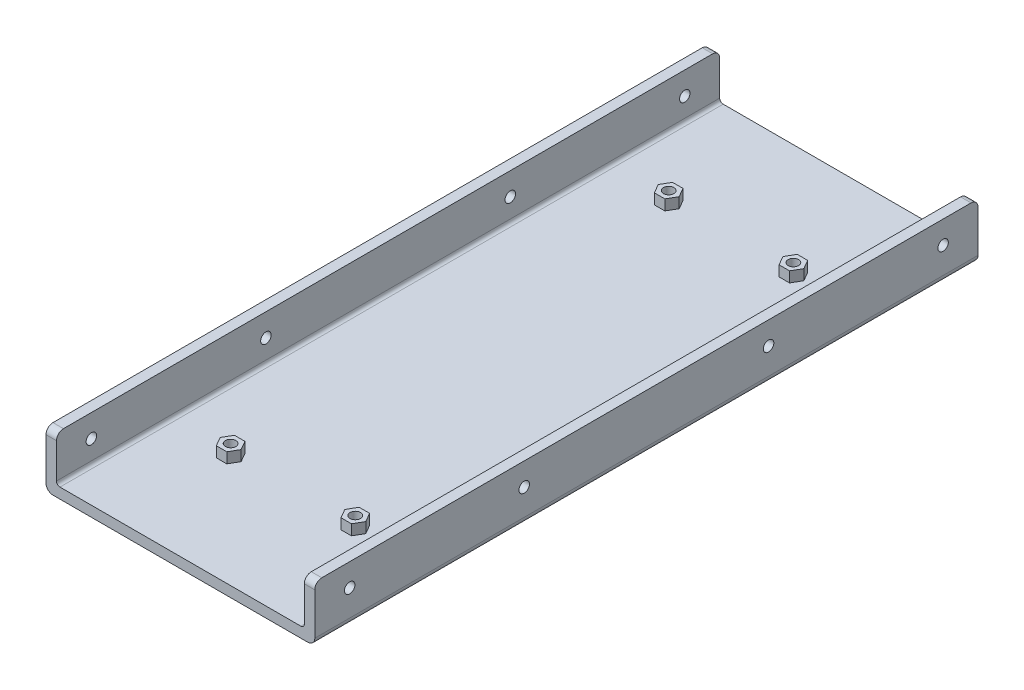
ISO-10303-21;
HEADER;
FILE_DESCRIPTION(('STEP AP214'),'2;1');
FILE_NAME('part.step','',(''),(''),'','','');
FILE_SCHEMA(('AUTOMOTIVE_DESIGN { 1 0 10303 214 1 1 1 1 }'));
ENDSEC;
DATA;
#1=APPLICATION_CONTEXT('core data for automotive mechanical design processes');
#2=APPLICATION_PROTOCOL_DEFINITION('international standard','automotive_design',2000,#1);
#3=PRODUCT_CONTEXT('',#1,'mechanical');
#4=PRODUCT('Part','Part','',(#3));
#5=PRODUCT_RELATED_PRODUCT_CATEGORY('part','',(#4));
#6=PRODUCT_DEFINITION_FORMATION('','',#4);
#7=PRODUCT_DEFINITION_CONTEXT('part definition',#1,'design');
#8=PRODUCT_DEFINITION('design','',#6,#7);
#9=PRODUCT_DEFINITION_SHAPE('','',#8);
#10=(LENGTH_UNIT() NAMED_UNIT(*) SI_UNIT(.MILLI.,.METRE.));
#11=(NAMED_UNIT(*) PLANE_ANGLE_UNIT() SI_UNIT($,.RADIAN.));
#12=(NAMED_UNIT(*) SI_UNIT($,.STERADIAN.) SOLID_ANGLE_UNIT());
#13=UNCERTAINTY_MEASURE_WITH_UNIT(LENGTH_MEASURE(1.E-05),#10,'distance_accuracy_value','');
#14=(GEOMETRIC_REPRESENTATION_CONTEXT(3) GLOBAL_UNCERTAINTY_ASSIGNED_CONTEXT((#13)) GLOBAL_UNIT_ASSIGNED_CONTEXT((#10,
#11,#12)) REPRESENTATION_CONTEXT('',''));
#15=CARTESIAN_POINT('',(0.,0.,0.));
#16=DIRECTION('',(0.,0.,1.));
#17=DIRECTION('',(1.,0.,0.));
#18=AXIS2_PLACEMENT_3D('',#15,#16,#17);
#19=CARTESIAN_POINT('',(49.522641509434,-31.340644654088,190.));
#20=DIRECTION('',(0.,1.,0.));
#21=DIRECTION('',(0.,0.,1.));
#22=AXIS2_PLACEMENT_3D('',#19,#20,#21);
#23=PLANE('',#22);
#24=CARTESIAN_POINT('',(-6.83697387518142,-31.340644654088,157.75));
#25=DIRECTION('',(0.,1.,0.));
#26=DIRECTION('',(0.,0.,1.));
#27=AXIS2_PLACEMENT_3D('',#24,#25,#26);
#28=CIRCLE('',#27,1.5);
#29=CARTESIAN_POINT('',(-6.83697387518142,-31.340644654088,159.25));
#30=VERTEX_POINT('',#29);
#31=EDGE_CURVE('E812',#30,#30,#28,.T.);
#32=ORIENTED_EDGE('',*,*,#31,.T.);
#33=EDGE_LOOP('',(#32));
#34=FACE_BOUND('',#33,.T.);
#35=CARTESIAN_POINT('',(28.8822568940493,-31.340644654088,32.25));
#36=DIRECTION('',(0.,1.,0.));
#37=DIRECTION('',(0.,0.,1.));
#38=AXIS2_PLACEMENT_3D('',#35,#36,#37);
#39=CIRCLE('',#38,1.5);
#40=CARTESIAN_POINT('',(28.8822568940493,-31.340644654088,33.75));
#41=VERTEX_POINT('',#40);
#42=EDGE_CURVE('E794',#41,#41,#39,.T.);
#43=ORIENTED_EDGE('',*,*,#42,.T.);
#44=EDGE_LOOP('',(#43));
#45=FACE_BOUND('',#44,.T.);
#46=CARTESIAN_POINT('',(-6.83697387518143,-31.340644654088,32.25));
#47=DIRECTION('',(0.,1.,0.));
#48=DIRECTION('',(0.,0.,1.));
#49=AXIS2_PLACEMENT_3D('',#46,#47,#48);
#50=CIRCLE('',#49,1.5);
#51=CARTESIAN_POINT('',(-6.83697387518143,-31.340644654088,33.75));
#52=VERTEX_POINT('',#51);
#53=EDGE_CURVE('E797',#52,#52,#50,.T.);
#54=ORIENTED_EDGE('',*,*,#53,.T.);
#55=EDGE_LOOP('',(#54));
#56=FACE_BOUND('',#55,.T.);
#57=CARTESIAN_POINT('',(28.8822568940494,-31.340644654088,157.75));
#58=DIRECTION('',(0.,1.,0.));
#59=DIRECTION('',(0.,0.,1.));
#60=AXIS2_PLACEMENT_3D('',#57,#58,#59);
#61=CIRCLE('',#60,1.50000000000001);
#62=CARTESIAN_POINT('',(28.8822568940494,-31.340644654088,159.25));
#63=VERTEX_POINT('',#62);
#64=EDGE_CURVE('E810',#63,#63,#61,.T.);
#65=ORIENTED_EDGE('',*,*,#64,.T.);
#66=EDGE_LOOP('',(#65));
#67=FACE_BOUND('',#66,.T.);
#68=DIRECTION('',(1.,0.,0.));
#69=VECTOR('',#68,1.);
#70=CARTESIAN_POINT('',(49.522641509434,-31.340644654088,0.));
#71=LINE('',#70,#69);
#72=CARTESIAN_POINT('',(-25.477358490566,-31.340644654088,0.));
#73=VERTEX_POINT('',#72);
#74=CARTESIAN_POINT('',(47.522641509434,-31.340644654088,0.));
#75=VERTEX_POINT('',#74);
#76=EDGE_CURVE('E613',#73,#75,#71,.T.);
#77=ORIENTED_EDGE('',*,*,#76,.T.);
#78=DIRECTION('',(0.,0.,-1.));
#79=VECTOR('',#78,1.);
#80=CARTESIAN_POINT('',(47.522641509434,-31.340644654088,190.));
#81=LINE('',#80,#79);
#82=CARTESIAN_POINT('',(47.522641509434,-31.340644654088,190.));
#83=VERTEX_POINT('',#82);
#84=EDGE_CURVE('E686',#75,#83,#81,.F.);
#85=ORIENTED_EDGE('',*,*,#84,.T.);
#86=DIRECTION('',(1.,0.,0.));
#87=VECTOR('',#86,1.);
#88=CARTESIAN_POINT('',(49.522641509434,-31.340644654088,190.));
#89=LINE('',#88,#87);
#90=CARTESIAN_POINT('',(-25.477358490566,-31.340644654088,190.));
#91=VERTEX_POINT('',#90);
#92=EDGE_CURVE('E614',#91,#83,#89,.T.);
#93=ORIENTED_EDGE('',*,*,#92,.F.);
#94=DIRECTION('',(0.,0.,-1.));
#95=VECTOR('',#94,1.);
#96=CARTESIAN_POINT('',(-25.477358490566,-31.340644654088,190.));
#97=LINE('',#96,#95);
#98=EDGE_CURVE('E682',#91,#73,#97,.T.);
#99=ORIENTED_EDGE('',*,*,#98,.T.);
#100=EDGE_LOOP('',(#77,#85,#93,#99));
#101=FACE_BOUND('',#100,.T.);
#102=ADVANCED_FACE('F42',(#34,#45,#56,#67,#101),#23,.F.);
#103=CARTESIAN_POINT('',(49.522641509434,-31.340644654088,190.));
#104=DIRECTION('',(-1.,0.,0.));
#105=DIRECTION('',(0.,0.,1.));
#106=AXIS2_PLACEMENT_3D('',#103,#104,#105);
#107=PLANE('',#106);
#108=CARTESIAN_POINT('',(49.522641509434,-21.8406446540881,10.));
#109=DIRECTION('',(-1.,0.,0.));
#110=DIRECTION('',(0.,0.,1.));
#111=AXIS2_PLACEMENT_3D('',#108,#109,#110);
#112=CIRCLE('',#111,1.5);
#113=CARTESIAN_POINT('',(49.522641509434,-21.8406446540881,11.5));
#114=VERTEX_POINT('',#113);
#115=EDGE_CURVE('E550',#114,#114,#112,.T.);
#116=ORIENTED_EDGE('',*,*,#115,.T.);
#117=EDGE_LOOP('',(#116));
#118=FACE_BOUND('',#117,.T.);
#119=CARTESIAN_POINT('',(49.522641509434,-21.8406446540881,60.));
#120=DIRECTION('',(-1.,0.,0.));
#121=DIRECTION('',(0.,0.,1.));
#122=AXIS2_PLACEMENT_3D('',#119,#120,#121);
#123=CIRCLE('',#122,1.50000000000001);
#124=CARTESIAN_POINT('',(49.522641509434,-21.8406446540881,61.5));
#125=VERTEX_POINT('',#124);
#126=EDGE_CURVE('E560',#125,#125,#123,.T.);
#127=ORIENTED_EDGE('',*,*,#126,.T.);
#128=EDGE_LOOP('',(#127));
#129=FACE_BOUND('',#128,.T.);
#130=CARTESIAN_POINT('',(49.522641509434,-21.8406446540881,130.));
#131=DIRECTION('',(-1.,0.,0.));
#132=DIRECTION('',(0.,0.,1.));
#133=AXIS2_PLACEMENT_3D('',#130,#131,#132);
#134=CIRCLE('',#133,1.5);
#135=CARTESIAN_POINT('',(49.522641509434,-21.8406446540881,131.5));
#136=VERTEX_POINT('',#135);
#137=EDGE_CURVE('E568',#136,#136,#134,.T.);
#138=ORIENTED_EDGE('',*,*,#137,.T.);
#139=EDGE_LOOP('',(#138));
#140=FACE_BOUND('',#139,.T.);
#141=CARTESIAN_POINT('',(49.522641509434,-21.8406446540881,180.));
#142=DIRECTION('',(-1.,0.,0.));
#143=DIRECTION('',(0.,0.,1.));
#144=AXIS2_PLACEMENT_3D('',#141,#142,#143);
#145=CIRCLE('',#144,1.5);
#146=CARTESIAN_POINT('',(49.522641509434,-21.8406446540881,181.5));
#147=VERTEX_POINT('',#146);
#148=EDGE_CURVE('E549',#147,#147,#145,.T.);
#149=ORIENTED_EDGE('',*,*,#148,.T.);
#150=EDGE_LOOP('',(#149));
#151=FACE_BOUND('',#150,.T.);
#152=DIRECTION('',(0.,0.,-1.));
#153=VECTOR('',#152,1.);
#154=CARTESIAN_POINT('',(49.522641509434,-15.340644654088,190.));
#155=LINE('',#154,#153);
#156=CARTESIAN_POINT('',(49.522641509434,-15.340644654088,188.));
#157=VERTEX_POINT('',#156);
#158=CARTESIAN_POINT('',(49.522641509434,-15.340644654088,2.));
#159=VERTEX_POINT('',#158);
#160=EDGE_CURVE('E668',#157,#159,#155,.T.);
#161=ORIENTED_EDGE('',*,*,#160,.F.);
#162=CARTESIAN_POINT('',(49.522641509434,-17.340644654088,188.));
#163=DIRECTION('',(-1.,0.,0.));
#164=DIRECTION('',(0.,0.,1.));
#165=AXIS2_PLACEMENT_3D('',#162,#163,#164);
#166=CIRCLE('',#165,2.);
#167=CARTESIAN_POINT('',(49.522641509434,-17.340644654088,190.));
#168=VERTEX_POINT('',#167);
#169=EDGE_CURVE('E769',#157,#168,#166,.F.);
#170=ORIENTED_EDGE('',*,*,#169,.T.);
#171=DIRECTION('',(0.,1.,0.));
#172=VECTOR('',#171,1.);
#173=CARTESIAN_POINT('',(49.522641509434,-31.340644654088,190.));
#174=LINE('',#173,#172);
#175=CARTESIAN_POINT('',(49.522641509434,-29.340644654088,190.));
#176=VERTEX_POINT('',#175);
#177=EDGE_CURVE('E618',#176,#168,#174,.T.);
#178=ORIENTED_EDGE('',*,*,#177,.F.);
#179=DIRECTION('',(0.,0.,-1.));
#180=VECTOR('',#179,1.);
#181=CARTESIAN_POINT('',(49.522641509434,-29.340644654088,190.));
#182=LINE('',#181,#180);
#183=CARTESIAN_POINT('',(49.522641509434,-29.340644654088,0.));
#184=VERTEX_POINT('',#183);
#185=EDGE_CURVE('E671',#176,#184,#182,.T.);
#186=ORIENTED_EDGE('',*,*,#185,.T.);
#187=DIRECTION('',(0.,1.,0.));
#188=VECTOR('',#187,1.);
#189=CARTESIAN_POINT('',(49.522641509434,-31.340644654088,0.));
#190=LINE('',#189,#188);
#191=CARTESIAN_POINT('',(49.522641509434,-17.340644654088,0.));
#192=VERTEX_POINT('',#191);
#193=EDGE_CURVE('E641',#184,#192,#190,.T.);
#194=ORIENTED_EDGE('',*,*,#193,.T.);
#195=CARTESIAN_POINT('',(49.522641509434,-17.340644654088,2.));
#196=DIRECTION('',(-1.,0.,0.));
#197=DIRECTION('',(0.,0.,1.));
#198=AXIS2_PLACEMENT_3D('',#195,#196,#197);
#199=CIRCLE('',#198,2.);
#200=EDGE_CURVE('E64',#192,#159,#199,.F.);
#201=ORIENTED_EDGE('',*,*,#200,.T.);
#202=EDGE_LOOP('',(#161,#170,#178,#186,#194,#201));
#203=FACE_BOUND('',#202,.T.);
#204=ADVANCED_FACE('F897',(#118,#129,#140,#151,#203),#107,.F.);
#205=CARTESIAN_POINT('',(49.522641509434,-15.340644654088,190.));
#206=DIRECTION('',(0.,-1.,0.));
#207=DIRECTION('',(1.,0.,0.));
#208=AXIS2_PLACEMENT_3D('',#205,#206,#207);
#209=PLANE('',#208);
#210=DIRECTION('',(0.,0.,-1.));
#211=VECTOR('',#210,1.);
#212=CARTESIAN_POINT('',(46.522641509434,-15.340644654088,190.));
#213=LINE('',#212,#211);
#214=CARTESIAN_POINT('',(46.522641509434,-15.340644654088,188.));
#215=VERTEX_POINT('',#214);
#216=CARTESIAN_POINT('',(46.522641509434,-15.340644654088,2.));
#217=VERTEX_POINT('',#216);
#218=EDGE_CURVE('E664',#215,#217,#213,.T.);
#219=ORIENTED_EDGE('',*,*,#218,.F.);
#220=DIRECTION('',(-1.,0.,0.));
#221=VECTOR('',#220,1.);
#222=CARTESIAN_POINT('',(49.522641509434,-15.340644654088,188.));
#223=LINE('',#222,#221);
#224=EDGE_CURVE('E764',#215,#157,#223,.F.);
#225=ORIENTED_EDGE('',*,*,#224,.T.);
#226=ORIENTED_EDGE('',*,*,#160,.T.);
#227=DIRECTION('',(-1.,0.,0.));
#228=VECTOR('',#227,1.);
#229=CARTESIAN_POINT('',(46.522641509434,-15.340644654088,2.));
#230=LINE('',#229,#228);
#231=EDGE_CURVE('E760',#159,#217,#230,.T.);
#232=ORIENTED_EDGE('',*,*,#231,.T.);
#233=EDGE_LOOP('',(#219,#225,#226,#232));
#234=FACE_BOUND('',#233,.T.);
#235=ADVANCED_FACE('F913',(#234),#209,.F.);
#236=CARTESIAN_POINT('',(46.522641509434,-15.340644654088,190.));
#237=DIRECTION('',(1.,0.,0.));
#238=DIRECTION('',(0.,0.,-1.));
#239=AXIS2_PLACEMENT_3D('',#236,#237,#238);
#240=PLANE('',#239);
#241=CARTESIAN_POINT('',(46.522641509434,-21.8406446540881,10.));
#242=DIRECTION('',(1.,0.,0.));
#243=DIRECTION('',(0.,0.,-1.));
#244=AXIS2_PLACEMENT_3D('',#241,#242,#243);
#245=CIRCLE('',#244,1.5);
#246=CARTESIAN_POINT('',(46.522641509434,-21.8406446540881,8.5));
#247=VERTEX_POINT('',#246);
#248=EDGE_CURVE('E609',#247,#247,#245,.F.);
#249=ORIENTED_EDGE('',*,*,#248,.F.);
#250=EDGE_LOOP('',(#249));
#251=FACE_BOUND('',#250,.T.);
#252=CARTESIAN_POINT('',(46.522641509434,-21.8406446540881,60.));
#253=DIRECTION('',(1.,0.,0.));
#254=DIRECTION('',(0.,0.,-1.));
#255=AXIS2_PLACEMENT_3D('',#252,#253,#254);
#256=CIRCLE('',#255,1.50000000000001);
#257=CARTESIAN_POINT('',(46.522641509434,-21.8406446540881,58.5));
#258=VERTEX_POINT('',#257);
#259=EDGE_CURVE('E601',#258,#258,#256,.F.);
#260=ORIENTED_EDGE('',*,*,#259,.F.);
#261=EDGE_LOOP('',(#260));
#262=FACE_BOUND('',#261,.T.);
#263=CARTESIAN_POINT('',(46.522641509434,-21.8406446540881,130.));
#264=DIRECTION('',(1.,0.,0.));
#265=DIRECTION('',(0.,0.,-1.));
#266=AXIS2_PLACEMENT_3D('',#263,#264,#265);
#267=CIRCLE('',#266,1.5);
#268=CARTESIAN_POINT('',(46.522641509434,-21.8406446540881,128.5));
#269=VERTEX_POINT('',#268);
#270=EDGE_CURVE('E593',#269,#269,#267,.F.);
#271=ORIENTED_EDGE('',*,*,#270,.F.);
#272=EDGE_LOOP('',(#271));
#273=FACE_BOUND('',#272,.T.);
#274=CARTESIAN_POINT('',(46.522641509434,-21.8406446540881,180.));
#275=DIRECTION('',(1.,0.,0.));
#276=DIRECTION('',(0.,0.,-1.));
#277=AXIS2_PLACEMENT_3D('',#274,#275,#276);
#278=CIRCLE('',#277,1.5);
#279=CARTESIAN_POINT('',(46.522641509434,-21.8406446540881,178.5));
#280=VERTEX_POINT('',#279);
#281=EDGE_CURVE('E585',#280,#280,#278,.F.);
#282=ORIENTED_EDGE('',*,*,#281,.F.);
#283=EDGE_LOOP('',(#282));
#284=FACE_BOUND('',#283,.T.);
#285=DIRECTION('',(0.,-1.,0.));
#286=VECTOR('',#285,1.);
#287=CARTESIAN_POINT('',(46.522641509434,-15.340644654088,190.));
#288=LINE('',#287,#286);
#289=CARTESIAN_POINT('',(46.522641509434,-17.340644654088,190.));
#290=VERTEX_POINT('',#289);
#291=CARTESIAN_POINT('',(46.522641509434,-27.340644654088,190.));
#292=VERTEX_POINT('',#291);
#293=EDGE_CURVE('E623',#290,#292,#288,.T.);
#294=ORIENTED_EDGE('',*,*,#293,.F.);
#295=CARTESIAN_POINT('',(46.522641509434,-17.340644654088,188.));
#296=DIRECTION('',(1.,0.,0.));
#297=DIRECTION('',(0.,0.,-1.));
#298=AXIS2_PLACEMENT_3D('',#295,#296,#297);
#299=CIRCLE('',#298,2.);
#300=EDGE_CURVE('E757',#290,#215,#299,.F.);
#301=ORIENTED_EDGE('',*,*,#300,.T.);
#302=ORIENTED_EDGE('',*,*,#218,.T.);
#303=CARTESIAN_POINT('',(46.522641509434,-17.340644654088,2.));
#304=DIRECTION('',(1.,0.,0.));
#305=DIRECTION('',(0.,0.,-1.));
#306=AXIS2_PLACEMENT_3D('',#303,#304,#305);
#307=CIRCLE('',#306,2.);
#308=CARTESIAN_POINT('',(46.522641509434,-17.340644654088,0.));
#309=VERTEX_POINT('',#308);
#310=EDGE_CURVE('E754',#217,#309,#307,.F.);
#311=ORIENTED_EDGE('',*,*,#310,.T.);
#312=DIRECTION('',(0.,-1.,0.));
#313=VECTOR('',#312,1.);
#314=CARTESIAN_POINT('',(46.522641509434,-15.340644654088,0.));
#315=LINE('',#314,#313);
#316=CARTESIAN_POINT('',(46.522641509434,-27.340644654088,0.));
#317=VERTEX_POINT('',#316);
#318=EDGE_CURVE('E644',#309,#317,#315,.T.);
#319=ORIENTED_EDGE('',*,*,#318,.T.);
#320=DIRECTION('',(0.,0.,-1.));
#321=VECTOR('',#320,1.);
#322=CARTESIAN_POINT('',(46.522641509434,-27.340644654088,190.));
#323=LINE('',#322,#321);
#324=EDGE_CURVE('E710',#317,#292,#323,.F.);
#325=ORIENTED_EDGE('',*,*,#324,.T.);
#326=EDGE_LOOP('',(#294,#301,#302,#311,#319,#325));
#327=FACE_BOUND('',#326,.T.);
#328=ADVANCED_FACE('F853',(#251,#262,#273,#284,#327),#240,.F.);
#329=CARTESIAN_POINT('',(46.522641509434,-28.340644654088,190.));
#330=DIRECTION('',(0.,-1.,0.));
#331=DIRECTION('',(0.,0.,-1.));
#332=AXIS2_PLACEMENT_3D('',#329,#330,#331);
#333=PLANE('',#332);
#334=DIRECTION('',(1.,0.,0.));
#335=VECTOR('',#334,1.);
#336=CARTESIAN_POINT('',(30.3822568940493,-28.340644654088,34.8480762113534));
#337=LINE('',#336,#335);
#338=CARTESIAN_POINT('',(27.3822568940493,-28.340644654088,34.8480762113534));
#339=VERTEX_POINT('',#338);
#340=CARTESIAN_POINT('',(30.3822568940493,-28.340644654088,34.8480762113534));
#341=VERTEX_POINT('',#340);
#342=EDGE_CURVE('E328',#339,#341,#337,.T.);
#343=ORIENTED_EDGE('',*,*,#342,.F.);
#344=DIRECTION('',(0.500000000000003,0.,0.866025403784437));
#345=VECTOR('',#344,1.);
#346=CARTESIAN_POINT('',(27.3822568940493,-28.340644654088,34.8480762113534));
#347=LINE('',#346,#345);
#348=CARTESIAN_POINT('',(25.8822568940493,-28.340644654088,32.2500000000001));
#349=VERTEX_POINT('',#348);
#350=EDGE_CURVE('E325',#349,#339,#347,.T.);
#351=ORIENTED_EDGE('',*,*,#350,.F.);
#352=DIRECTION('',(-0.499999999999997,0.,0.86602540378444));
#353=VECTOR('',#352,1.);
#354=CARTESIAN_POINT('',(25.8822568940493,-28.340644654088,32.2500000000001));
#355=LINE('',#354,#353);
#356=CARTESIAN_POINT('',(27.3822568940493,-28.340644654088,29.6519237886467));
#357=VERTEX_POINT('',#356);
#358=EDGE_CURVE('E779',#357,#349,#355,.T.);
#359=ORIENTED_EDGE('',*,*,#358,.F.);
#360=DIRECTION('',(-1.,0.,0.));
#361=VECTOR('',#360,1.);
#362=CARTESIAN_POINT('',(27.3822568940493,-28.340644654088,29.6519237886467));
#363=LINE('',#362,#361);
#364=CARTESIAN_POINT('',(30.3822568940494,-28.340644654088,29.6519237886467));
#365=VERTEX_POINT('',#364);
#366=EDGE_CURVE('E775',#365,#357,#363,.T.);
#367=ORIENTED_EDGE('',*,*,#366,.F.);
#368=DIRECTION('',(-0.5,0.,-0.866025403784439));
#369=VECTOR('',#368,1.);
#370=CARTESIAN_POINT('',(30.3822568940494,-28.340644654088,29.6519237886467));
#371=LINE('',#370,#369);
#372=CARTESIAN_POINT('',(31.8822568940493,-28.340644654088,32.25));
#373=VERTEX_POINT('',#372);
#374=EDGE_CURVE('E773',#373,#365,#371,.T.);
#375=ORIENTED_EDGE('',*,*,#374,.F.);
#376=DIRECTION('',(0.500000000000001,0.,-0.866025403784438));
#377=VECTOR('',#376,1.);
#378=CARTESIAN_POINT('',(31.8822568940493,-28.340644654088,32.25));
#379=LINE('',#378,#377);
#380=EDGE_CURVE('E776',#341,#373,#379,.T.);
#381=ORIENTED_EDGE('',*,*,#380,.F.);
#382=EDGE_LOOP('',(#343,#351,#359,#367,#375,#381));
#383=FACE_BOUND('',#382,.T.);
#384=DIRECTION('',(0.500000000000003,0.,-0.866025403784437));
#385=VECTOR('',#384,1.);
#386=CARTESIAN_POINT('',(-5.33697387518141,-28.340644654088,34.8480762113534));
#387=LINE('',#386,#385);
#388=CARTESIAN_POINT('',(-5.33697387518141,-28.340644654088,34.8480762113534));
#389=VERTEX_POINT('',#388);
#390=CARTESIAN_POINT('',(-3.83697387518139,-28.340644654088,32.2500000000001));
#391=VERTEX_POINT('',#390);
#392=EDGE_CURVE('E335',#389,#391,#387,.T.);
#393=ORIENTED_EDGE('',*,*,#392,.F.);
#394=DIRECTION('',(1.,0.,0.));
#395=VECTOR('',#394,1.);
#396=CARTESIAN_POINT('',(-8.3369738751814,-28.340644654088,34.8480762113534));
#397=LINE('',#396,#395);
#398=CARTESIAN_POINT('',(-8.3369738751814,-28.340644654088,34.8480762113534));
#399=VERTEX_POINT('',#398);
#400=EDGE_CURVE('E347',#399,#389,#397,.T.);
#401=ORIENTED_EDGE('',*,*,#400,.F.);
#402=DIRECTION('',(0.500000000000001,0.,0.866025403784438));
#403=VECTOR('',#402,1.);
#404=CARTESIAN_POINT('',(-9.83697387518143,-28.340644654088,32.25));
#405=LINE('',#404,#403);
#406=CARTESIAN_POINT('',(-9.83697387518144,-28.340644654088,32.25));
#407=VERTEX_POINT('',#406);
#408=EDGE_CURVE('E378',#407,#399,#405,.T.);
#409=ORIENTED_EDGE('',*,*,#408,.F.);
#410=DIRECTION('',(-0.5,0.,0.866025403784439));
#411=VECTOR('',#410,1.);
#412=CARTESIAN_POINT('',(-8.33697387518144,-28.340644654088,29.6519237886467));
#413=LINE('',#412,#411);
#414=CARTESIAN_POINT('',(-8.33697387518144,-28.340644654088,29.6519237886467));
#415=VERTEX_POINT('',#414);
#416=EDGE_CURVE('E374',#415,#407,#413,.T.);
#417=ORIENTED_EDGE('',*,*,#416,.F.);
#418=DIRECTION('',(-1.,0.,0.));
#419=VECTOR('',#418,1.);
#420=CARTESIAN_POINT('',(-5.33697387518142,-28.340644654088,29.6519237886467));
#421=LINE('',#420,#419);
#422=CARTESIAN_POINT('',(-5.33697387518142,-28.340644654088,29.6519237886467));
#423=VERTEX_POINT('',#422);
#424=EDGE_CURVE('E370',#423,#415,#421,.T.);
#425=ORIENTED_EDGE('',*,*,#424,.F.);
#426=DIRECTION('',(-0.499999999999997,0.,-0.86602540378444));
#427=VECTOR('',#426,1.);
#428=CARTESIAN_POINT('',(-3.83697387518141,-28.340644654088,32.2500000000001));
#429=LINE('',#428,#427);
#430=EDGE_CURVE('E366',#391,#423,#429,.T.);
#431=ORIENTED_EDGE('',*,*,#430,.F.);
#432=EDGE_LOOP('',(#393,#401,#409,#417,#425,#431));
#433=FACE_BOUND('',#432,.T.);
#434=DIRECTION('',(-1.,0.,0.));
#435=VECTOR('',#434,1.);
#436=CARTESIAN_POINT('',(-8.33697387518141,-28.340644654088,155.151923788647));
#437=LINE('',#436,#435);
#438=CARTESIAN_POINT('',(-5.33697387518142,-28.340644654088,155.151923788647));
#439=VERTEX_POINT('',#438);
#440=CARTESIAN_POINT('',(-8.3369738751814,-28.340644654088,155.151923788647));
#441=VERTEX_POINT('',#440);
#442=EDGE_CURVE('E412',#439,#441,#437,.T.);
#443=ORIENTED_EDGE('',*,*,#442,.F.);
#444=DIRECTION('',(-0.500000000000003,0.,-0.866025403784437));
#445=VECTOR('',#444,1.);
#446=CARTESIAN_POINT('',(-5.33697387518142,-28.340644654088,155.151923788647));
#447=LINE('',#446,#445);
#448=CARTESIAN_POINT('',(-3.83697387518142,-28.340644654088,157.75));
#449=VERTEX_POINT('',#448);
#450=EDGE_CURVE('E418',#449,#439,#447,.T.);
#451=ORIENTED_EDGE('',*,*,#450,.F.);
#452=DIRECTION('',(0.499999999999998,0.,-0.86602540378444));
#453=VECTOR('',#452,1.);
#454=CARTESIAN_POINT('',(-3.83697387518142,-28.340644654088,157.75));
#455=LINE('',#454,#453);
#456=CARTESIAN_POINT('',(-5.33697387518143,-28.340644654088,160.348076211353));
#457=VERTEX_POINT('',#456);
#458=EDGE_CURVE('E449',#457,#449,#455,.T.);
#459=ORIENTED_EDGE('',*,*,#458,.F.);
#460=DIRECTION('',(1.,0.,0.));
#461=VECTOR('',#460,1.);
#462=CARTESIAN_POINT('',(-5.33697387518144,-28.340644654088,160.348076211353));
#463=LINE('',#462,#461);
#464=CARTESIAN_POINT('',(-8.33697387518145,-28.340644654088,160.348076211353));
#465=VERTEX_POINT('',#464);
#466=EDGE_CURVE('E445',#465,#457,#463,.T.);
#467=ORIENTED_EDGE('',*,*,#466,.F.);
#468=DIRECTION('',(0.499999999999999,0.,0.866025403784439));
#469=VECTOR('',#468,1.);
#470=CARTESIAN_POINT('',(-8.33697387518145,-28.340644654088,160.348076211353));
#471=LINE('',#470,#469);
#472=CARTESIAN_POINT('',(-9.83697387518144,-28.340644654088,157.75));
#473=VERTEX_POINT('',#472);
#474=EDGE_CURVE('E441',#473,#465,#471,.T.);
#475=ORIENTED_EDGE('',*,*,#474,.F.);
#476=DIRECTION('',(-0.500000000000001,0.,0.866025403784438));
#477=VECTOR('',#476,1.);
#478=CARTESIAN_POINT('',(-9.83697387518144,-28.340644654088,157.75));
#479=LINE('',#478,#477);
#480=EDGE_CURVE('E437',#441,#473,#479,.T.);
#481=ORIENTED_EDGE('',*,*,#480,.F.);
#482=EDGE_LOOP('',(#443,#451,#459,#467,#475,#481));
#483=FACE_BOUND('',#482,.T.);
#484=DIRECTION('',(-0.500000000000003,0.,0.866025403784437));
#485=VECTOR('',#484,1.);
#486=CARTESIAN_POINT('',(27.3822568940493,-28.340644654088,155.151923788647));
#487=LINE('',#486,#485);
#488=CARTESIAN_POINT('',(27.3822568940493,-28.340644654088,155.151923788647));
#489=VERTEX_POINT('',#488);
#490=CARTESIAN_POINT('',(25.8822568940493,-28.340644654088,157.75));
#491=VERTEX_POINT('',#490);
#492=EDGE_CURVE('E482',#489,#491,#487,.T.);
#493=ORIENTED_EDGE('',*,*,#492,.F.);
#494=DIRECTION('',(-1.,0.,0.));
#495=VECTOR('',#494,1.);
#496=CARTESIAN_POINT('',(30.3822568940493,-28.340644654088,155.151923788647));
#497=LINE('',#496,#495);
#498=CARTESIAN_POINT('',(30.3822568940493,-28.340644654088,155.151923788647));
#499=VERTEX_POINT('',#498);
#500=EDGE_CURVE('E488',#499,#489,#497,.T.);
#501=ORIENTED_EDGE('',*,*,#500,.F.);
#502=DIRECTION('',(-0.500000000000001,0.,-0.866025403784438));
#503=VECTOR('',#502,1.);
#504=CARTESIAN_POINT('',(31.8822568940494,-28.340644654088,157.75));
#505=LINE('',#504,#503);
#506=CARTESIAN_POINT('',(31.8822568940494,-28.340644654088,157.75));
#507=VERTEX_POINT('',#506);
#508=EDGE_CURVE('E519',#507,#499,#505,.T.);
#509=ORIENTED_EDGE('',*,*,#508,.F.);
#510=DIRECTION('',(0.499999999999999,0.,-0.866025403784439));
#511=VECTOR('',#510,1.);
#512=CARTESIAN_POINT('',(30.3822568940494,-28.340644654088,160.348076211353));
#513=LINE('',#512,#511);
#514=CARTESIAN_POINT('',(30.3822568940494,-28.340644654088,160.348076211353));
#515=VERTEX_POINT('',#514);
#516=EDGE_CURVE('E515',#515,#507,#513,.T.);
#517=ORIENTED_EDGE('',*,*,#516,.F.);
#518=DIRECTION('',(1.,0.,0.));
#519=VECTOR('',#518,1.);
#520=CARTESIAN_POINT('',(27.3822568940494,-28.340644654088,160.348076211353));
#521=LINE('',#520,#519);
#522=CARTESIAN_POINT('',(27.3822568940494,-28.340644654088,160.348076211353));
#523=VERTEX_POINT('',#522);
#524=EDGE_CURVE('E511',#523,#515,#521,.T.);
#525=ORIENTED_EDGE('',*,*,#524,.F.);
#526=DIRECTION('',(0.499999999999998,0.,0.86602540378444));
#527=VECTOR('',#526,1.);
#528=CARTESIAN_POINT('',(25.8822568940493,-28.340644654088,157.75));
#529=LINE('',#528,#527);
#530=EDGE_CURVE('E507',#491,#523,#529,.T.);
#531=ORIENTED_EDGE('',*,*,#530,.F.);
#532=EDGE_LOOP('',(#493,#501,#509,#517,#525,#531));
#533=FACE_BOUND('',#532,.T.);
#534=DIRECTION('',(-1.,0.,0.));
#535=VECTOR('',#534,1.);
#536=CARTESIAN_POINT('',(46.522641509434,-28.340644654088,0.));
#537=LINE('',#536,#535);
#538=CARTESIAN_POINT('',(45.522641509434,-28.340644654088,0.));
#539=VERTEX_POINT('',#538);
#540=CARTESIAN_POINT('',(-23.477358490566,-28.340644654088,0.));
#541=VERTEX_POINT('',#540);
#542=EDGE_CURVE('E647',#539,#541,#537,.T.);
#543=ORIENTED_EDGE('',*,*,#542,.T.);
#544=DIRECTION('',(0.,0.,-1.));
#545=VECTOR('',#544,1.);
#546=CARTESIAN_POINT('',(-23.477358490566,-28.340644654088,190.));
#547=LINE('',#546,#545);
#548=CARTESIAN_POINT('',(-23.477358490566,-28.340644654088,190.));
#549=VERTEX_POINT('',#548);
#550=EDGE_CURVE('E707',#541,#549,#547,.F.);
#551=ORIENTED_EDGE('',*,*,#550,.T.);
#552=DIRECTION('',(-1.,0.,0.));
#553=VECTOR('',#552,1.);
#554=CARTESIAN_POINT('',(46.522641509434,-28.340644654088,190.));
#555=LINE('',#554,#553);
#556=CARTESIAN_POINT('',(45.522641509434,-28.340644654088,190.));
#557=VERTEX_POINT('',#556);
#558=EDGE_CURVE('E626',#557,#549,#555,.T.);
#559=ORIENTED_EDGE('',*,*,#558,.F.);
#560=DIRECTION('',(0.,0.,-1.));
#561=VECTOR('',#560,1.);
#562=CARTESIAN_POINT('',(45.522641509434,-28.340644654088,0.));
#563=LINE('',#562,#561);
#564=EDGE_CURVE('E703',#557,#539,#563,.T.);
#565=ORIENTED_EDGE('',*,*,#564,.T.);
#566=EDGE_LOOP('',(#543,#551,#559,#565));
#567=FACE_BOUND('',#566,.T.);
#568=ADVANCED_FACE('F849',(#383,#433,#483,#533,#567),#333,.F.);
#569=CARTESIAN_POINT('',(-24.477358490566,-15.340644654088,190.));
#570=DIRECTION('',(-1.,0.,0.));
#571=DIRECTION('',(0.,0.,1.));
#572=AXIS2_PLACEMENT_3D('',#569,#570,#571);
#573=PLANE('',#572);
#574=CARTESIAN_POINT('',(-24.477358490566,-21.8406446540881,10.));
#575=DIRECTION('',(-1.,0.,0.));
#576=DIRECTION('',(0.,0.,1.));
#577=AXIS2_PLACEMENT_3D('',#574,#575,#576);
#578=CIRCLE('',#577,1.5);
#579=CARTESIAN_POINT('',(-24.477358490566,-21.8406446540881,11.5));
#580=VERTEX_POINT('',#579);
#581=EDGE_CURVE('E605',#580,#580,#578,.F.);
#582=ORIENTED_EDGE('',*,*,#581,.F.);
#583=EDGE_LOOP('',(#582));
#584=FACE_BOUND('',#583,.T.);
#585=CARTESIAN_POINT('',(-24.477358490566,-21.8406446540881,60.));
#586=DIRECTION('',(-1.,0.,0.));
#587=DIRECTION('',(0.,0.,1.));
#588=AXIS2_PLACEMENT_3D('',#585,#586,#587);
#589=CIRCLE('',#588,1.50000000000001);
#590=CARTESIAN_POINT('',(-24.477358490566,-21.8406446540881,61.5));
#591=VERTEX_POINT('',#590);
#592=EDGE_CURVE('E597',#591,#591,#589,.F.);
#593=ORIENTED_EDGE('',*,*,#592,.F.);
#594=EDGE_LOOP('',(#593));
#595=FACE_BOUND('',#594,.T.);
#596=CARTESIAN_POINT('',(-24.477358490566,-21.8406446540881,130.));
#597=DIRECTION('',(-1.,0.,0.));
#598=DIRECTION('',(0.,0.,1.));
#599=AXIS2_PLACEMENT_3D('',#596,#597,#598);
#600=CIRCLE('',#599,1.5);
#601=CARTESIAN_POINT('',(-24.477358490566,-21.8406446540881,131.5));
#602=VERTEX_POINT('',#601);
#603=EDGE_CURVE('E589',#602,#602,#600,.F.);
#604=ORIENTED_EDGE('',*,*,#603,.F.);
#605=EDGE_LOOP('',(#604));
#606=FACE_BOUND('',#605,.T.);
#607=CARTESIAN_POINT('',(-24.477358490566,-21.8406446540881,180.));
#608=DIRECTION('',(-1.,0.,0.));
#609=DIRECTION('',(0.,0.,1.));
#610=AXIS2_PLACEMENT_3D('',#607,#608,#609);
#611=CIRCLE('',#610,1.5);
#612=CARTESIAN_POINT('',(-24.477358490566,-21.8406446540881,181.5));
#613=VERTEX_POINT('',#612);
#614=EDGE_CURVE('E559',#613,#613,#611,.F.);
#615=ORIENTED_EDGE('',*,*,#614,.F.);
#616=EDGE_LOOP('',(#615));
#617=FACE_BOUND('',#616,.T.);
#618=DIRECTION('',(0.,0.,-1.));
#619=VECTOR('',#618,1.);
#620=CARTESIAN_POINT('',(-24.477358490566,-15.340644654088,190.));
#621=LINE('',#620,#619);
#622=CARTESIAN_POINT('',(-24.477358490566,-15.340644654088,188.));
#623=VERTEX_POINT('',#622);
#624=CARTESIAN_POINT('',(-24.477358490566,-15.340644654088,2.));
#625=VERTEX_POINT('',#624);
#626=EDGE_CURVE('E660',#623,#625,#621,.T.);
#627=ORIENTED_EDGE('',*,*,#626,.F.);
#628=CARTESIAN_POINT('',(-24.477358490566,-17.340644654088,188.));
#629=DIRECTION('',(-1.,0.,0.));
#630=DIRECTION('',(0.,0.,1.));
#631=AXIS2_PLACEMENT_3D('',#628,#629,#630);
#632=CIRCLE('',#631,2.);
#633=CARTESIAN_POINT('',(-24.477358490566,-17.340644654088,190.));
#634=VERTEX_POINT('',#633);
#635=EDGE_CURVE('E751',#623,#634,#632,.F.);
#636=ORIENTED_EDGE('',*,*,#635,.T.);
#637=DIRECTION('',(0.,1.,0.));
#638=VECTOR('',#637,1.);
#639=CARTESIAN_POINT('',(-24.477358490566,-15.340644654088,190.));
#640=LINE('',#639,#638);
#641=CARTESIAN_POINT('',(-24.477358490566,-27.340644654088,190.));
#642=VERTEX_POINT('',#641);
#643=EDGE_CURVE('E630',#642,#634,#640,.T.);
#644=ORIENTED_EDGE('',*,*,#643,.F.);
#645=DIRECTION('',(0.,0.,-1.));
#646=VECTOR('',#645,1.);
#647=CARTESIAN_POINT('',(-24.477358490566,-27.340644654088,0.));
#648=LINE('',#647,#646);
#649=CARTESIAN_POINT('',(-24.477358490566,-27.340644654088,0.));
#650=VERTEX_POINT('',#649);
#651=EDGE_CURVE('E699',#642,#650,#648,.T.);
#652=ORIENTED_EDGE('',*,*,#651,.T.);
#653=DIRECTION('',(0.,1.,0.));
#654=VECTOR('',#653,1.);
#655=CARTESIAN_POINT('',(-24.477358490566,-15.340644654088,0.));
#656=LINE('',#655,#654);
#657=CARTESIAN_POINT('',(-24.477358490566,-17.340644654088,0.));
#658=VERTEX_POINT('',#657);
#659=EDGE_CURVE('E651',#650,#658,#656,.T.);
#660=ORIENTED_EDGE('',*,*,#659,.T.);
#661=CARTESIAN_POINT('',(-24.477358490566,-17.340644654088,2.));
#662=DIRECTION('',(-1.,0.,0.));
#663=DIRECTION('',(0.,0.,1.));
#664=AXIS2_PLACEMENT_3D('',#661,#662,#663);
#665=CIRCLE('',#664,2.);
#666=EDGE_CURVE('E748',#658,#625,#665,.F.);
#667=ORIENTED_EDGE('',*,*,#666,.T.);
#668=EDGE_LOOP('',(#627,#636,#644,#652,#660,#667));
#669=FACE_BOUND('',#668,.T.);
#670=ADVANCED_FACE('F852',(#584,#595,#606,#617,#669),#573,.F.);
#671=CARTESIAN_POINT('',(-27.477358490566,-15.340644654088,190.));
#672=DIRECTION('',(0.,-1.,0.));
#673=DIRECTION('',(0.,0.,-1.));
#674=AXIS2_PLACEMENT_3D('',#671,#672,#673);
#675=PLANE('',#674);
#676=DIRECTION('',(0.,0.,-1.));
#677=VECTOR('',#676,1.);
#678=CARTESIAN_POINT('',(-27.477358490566,-15.340644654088,190.));
#679=LINE('',#678,#677);
#680=CARTESIAN_POINT('',(-27.477358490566,-15.340644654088,188.));
#681=VERTEX_POINT('',#680);
#682=CARTESIAN_POINT('',(-27.477358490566,-15.340644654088,2.));
#683=VERTEX_POINT('',#682);
#684=EDGE_CURVE('E637',#681,#683,#679,.T.);
#685=ORIENTED_EDGE('',*,*,#684,.F.);
#686=DIRECTION('',(-1.,0.,0.));
#687=VECTOR('',#686,1.);
#688=CARTESIAN_POINT('',(-27.477358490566,-15.340644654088,188.));
#689=LINE('',#688,#687);
#690=EDGE_CURVE('E745',#681,#623,#689,.F.);
#691=ORIENTED_EDGE('',*,*,#690,.T.);
#692=ORIENTED_EDGE('',*,*,#626,.T.);
#693=DIRECTION('',(-1.,0.,0.));
#694=VECTOR('',#693,1.);
#695=CARTESIAN_POINT('',(-27.477358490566,-15.340644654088,2.));
#696=LINE('',#695,#694);
#697=EDGE_CURVE('E741',#625,#683,#696,.T.);
#698=ORIENTED_EDGE('',*,*,#697,.T.);
#699=EDGE_LOOP('',(#685,#691,#692,#698));
#700=FACE_BOUND('',#699,.T.);
#701=ADVANCED_FACE('F954',(#700),#675,.F.);
#702=CARTESIAN_POINT('',(-27.477358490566,-31.340644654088,190.));
#703=DIRECTION('',(1.,0.,0.));
#704=DIRECTION('',(0.,0.,-1.));
#705=AXIS2_PLACEMENT_3D('',#702,#703,#704);
#706=PLANE('',#705);
#707=CARTESIAN_POINT('',(-27.477358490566,-21.8406446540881,10.));
#708=DIRECTION('',(1.,0.,0.));
#709=DIRECTION('',(0.,0.,-1.));
#710=AXIS2_PLACEMENT_3D('',#707,#708,#709);
#711=CIRCLE('',#710,1.5);
#712=CARTESIAN_POINT('',(-27.477358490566,-21.8406446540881,8.5));
#713=VERTEX_POINT('',#712);
#714=EDGE_CURVE('E554',#713,#713,#711,.T.);
#715=ORIENTED_EDGE('',*,*,#714,.T.);
#716=EDGE_LOOP('',(#715));
#717=FACE_BOUND('',#716,.T.);
#718=CARTESIAN_POINT('',(-27.477358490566,-21.8406446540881,60.));
#719=DIRECTION('',(1.,0.,0.));
#720=DIRECTION('',(0.,0.,-1.));
#721=AXIS2_PLACEMENT_3D('',#718,#719,#720);
#722=CIRCLE('',#721,1.50000000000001);
#723=CARTESIAN_POINT('',(-27.477358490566,-21.8406446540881,58.5));
#724=VERTEX_POINT('',#723);
#725=EDGE_CURVE('E555',#724,#724,#722,.T.);
#726=ORIENTED_EDGE('',*,*,#725,.T.);
#727=EDGE_LOOP('',(#726));
#728=FACE_BOUND('',#727,.T.);
#729=CARTESIAN_POINT('',(-27.477358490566,-21.8406446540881,130.));
#730=DIRECTION('',(1.,0.,0.));
#731=DIRECTION('',(0.,0.,-1.));
#732=AXIS2_PLACEMENT_3D('',#729,#730,#731);
#733=CIRCLE('',#732,1.5);
#734=CARTESIAN_POINT('',(-27.477358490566,-21.8406446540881,128.5));
#735=VERTEX_POINT('',#734);
#736=EDGE_CURVE('E564',#735,#735,#733,.T.);
#737=ORIENTED_EDGE('',*,*,#736,.T.);
#738=EDGE_LOOP('',(#737));
#739=FACE_BOUND('',#738,.T.);
#740=CARTESIAN_POINT('',(-27.477358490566,-21.8406446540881,180.));
#741=DIRECTION('',(1.,0.,0.));
#742=DIRECTION('',(0.,0.,-1.));
#743=AXIS2_PLACEMENT_3D('',#740,#741,#742);
#744=CIRCLE('',#743,1.5);
#745=CARTESIAN_POINT('',(-27.477358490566,-21.8406446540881,178.5));
#746=VERTEX_POINT('',#745);
#747=EDGE_CURVE('E572',#746,#746,#744,.T.);
#748=ORIENTED_EDGE('',*,*,#747,.T.);
#749=EDGE_LOOP('',(#748));
#750=FACE_BOUND('',#749,.T.);
#751=DIRECTION('',(0.,-1.,0.));
#752=VECTOR('',#751,1.);
#753=CARTESIAN_POINT('',(-27.477358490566,-31.340644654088,190.));
#754=LINE('',#753,#752);
#755=CARTESIAN_POINT('',(-27.477358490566,-17.340644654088,190.));
#756=VERTEX_POINT('',#755);
#757=CARTESIAN_POINT('',(-27.477358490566,-29.340644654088,190.));
#758=VERTEX_POINT('',#757);
#759=EDGE_CURVE('E634',#756,#758,#754,.T.);
#760=ORIENTED_EDGE('',*,*,#759,.F.);
#761=CARTESIAN_POINT('',(-27.477358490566,-17.340644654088,188.));
#762=DIRECTION('',(1.,0.,0.));
#763=DIRECTION('',(0.,0.,-1.));
#764=AXIS2_PLACEMENT_3D('',#761,#762,#763);
#765=CIRCLE('',#764,2.);
#766=EDGE_CURVE('E738',#756,#681,#765,.F.);
#767=ORIENTED_EDGE('',*,*,#766,.T.);
#768=ORIENTED_EDGE('',*,*,#684,.T.);
#769=CARTESIAN_POINT('',(-27.477358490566,-17.340644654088,2.));
#770=DIRECTION('',(1.,0.,0.));
#771=DIRECTION('',(0.,0.,-1.));
#772=AXIS2_PLACEMENT_3D('',#769,#770,#771);
#773=CIRCLE('',#772,2.);
#774=CARTESIAN_POINT('',(-27.477358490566,-17.340644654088,0.));
#775=VERTEX_POINT('',#774);
#776=EDGE_CURVE('E735',#683,#775,#773,.F.);
#777=ORIENTED_EDGE('',*,*,#776,.T.);
#778=DIRECTION('',(0.,-1.,0.));
#779=VECTOR('',#778,1.);
#780=CARTESIAN_POINT('',(-27.477358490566,-31.340644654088,0.));
#781=LINE('',#780,#779);
#782=CARTESIAN_POINT('',(-27.477358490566,-29.340644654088,0.));
#783=VERTEX_POINT('',#782);
#784=EDGE_CURVE('E619',#775,#783,#781,.T.);
#785=ORIENTED_EDGE('',*,*,#784,.T.);
#786=DIRECTION('',(0.,0.,-1.));
#787=VECTOR('',#786,1.);
#788=CARTESIAN_POINT('',(-27.477358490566,-29.340644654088,190.));
#789=LINE('',#788,#787);
#790=EDGE_CURVE('E695',#783,#758,#789,.F.);
#791=ORIENTED_EDGE('',*,*,#790,.T.);
#792=EDGE_LOOP('',(#760,#767,#768,#777,#785,#791));
#793=FACE_BOUND('',#792,.T.);
#794=ADVANCED_FACE('F879',(#717,#728,#739,#750,#793),#706,.F.);
#795=CARTESIAN_POINT('',(0.,0.,190.));
#796=DIRECTION('',(0.,0.,-1.));
#797=DIRECTION('',(-1.,0.,0.));
#798=AXIS2_PLACEMENT_3D('',#795,#796,#797);
#799=PLANE('',#798);
#800=ORIENTED_EDGE('',*,*,#643,.T.);
#801=DIRECTION('',(-1.,0.,0.));
#802=VECTOR('',#801,1.);
#803=CARTESIAN_POINT('',(0.,-17.340644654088,190.));
#804=LINE('',#803,#802);
#805=EDGE_CURVE('E731',#634,#756,#804,.T.);
#806=ORIENTED_EDGE('',*,*,#805,.T.);
#807=ORIENTED_EDGE('',*,*,#759,.T.);
#808=CARTESIAN_POINT('',(-25.477358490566,-29.340644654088,190.));
#809=DIRECTION('',(0.,0.,-1.));
#810=DIRECTION('',(-1.,0.,0.));
#811=AXIS2_PLACEMENT_3D('',#808,#809,#810);
#812=CIRCLE('',#811,2.);
#813=EDGE_CURVE('E689',#758,#91,#812,.F.);
#814=ORIENTED_EDGE('',*,*,#813,.T.);
#815=ORIENTED_EDGE('',*,*,#92,.T.);
#816=CARTESIAN_POINT('',(47.522641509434,-29.340644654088,190.));
#817=DIRECTION('',(0.,0.,-1.));
#818=DIRECTION('',(-1.,0.,0.));
#819=AXIS2_PLACEMENT_3D('',#816,#817,#818);
#820=CIRCLE('',#819,2.);
#821=EDGE_CURVE('E692',#83,#176,#820,.F.);
#822=ORIENTED_EDGE('',*,*,#821,.T.);
#823=ORIENTED_EDGE('',*,*,#177,.T.);
#824=DIRECTION('',(-1.,0.,0.));
#825=VECTOR('',#824,1.);
#826=CARTESIAN_POINT('',(0.,-17.3406446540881,190.));
#827=LINE('',#826,#825);
#828=EDGE_CURVE('E727',#168,#290,#827,.T.);
#829=ORIENTED_EDGE('',*,*,#828,.T.);
#830=ORIENTED_EDGE('',*,*,#293,.T.);
#831=CARTESIAN_POINT('',(45.522641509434,-27.340644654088,190.));
#832=DIRECTION('',(0.,0.,-1.));
#833=DIRECTION('',(-1.,0.,0.));
#834=AXIS2_PLACEMENT_3D('',#831,#832,#833);
#835=CIRCLE('',#834,1.);
#836=EDGE_CURVE('E724',#292,#557,#835,.T.);
#837=ORIENTED_EDGE('',*,*,#836,.T.);
#838=ORIENTED_EDGE('',*,*,#558,.T.);
#839=CARTESIAN_POINT('',(-23.477358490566,-27.340644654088,190.));
#840=DIRECTION('',(0.,0.,-1.));
#841=DIRECTION('',(-1.,0.,0.));
#842=AXIS2_PLACEMENT_3D('',#839,#840,#841);
#843=CIRCLE('',#842,1.);
#844=EDGE_CURVE('E717',#549,#642,#843,.T.);
#845=ORIENTED_EDGE('',*,*,#844,.T.);
#846=EDGE_LOOP('',(#800,#806,#807,#814,#815,#822,#823,#829,#830,#837,#838,#845));
#847=FACE_BOUND('',#846,.T.);
#848=ADVANCED_FACE('F868',(#847),#799,.F.);
#849=CARTESIAN_POINT('',(0.,0.,0.));
#850=DIRECTION('',(0.,0.,-1.));
#851=DIRECTION('',(-1.,0.,0.));
#852=AXIS2_PLACEMENT_3D('',#849,#850,#851);
#853=PLANE('',#852);
#854=ORIENTED_EDGE('',*,*,#784,.F.);
#855=DIRECTION('',(-1.,0.,0.));
#856=VECTOR('',#855,1.);
#857=CARTESIAN_POINT('',(-24.477358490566,-17.340644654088,0.));
#858=LINE('',#857,#856);
#859=EDGE_CURVE('E11',#775,#658,#858,.F.);
#860=ORIENTED_EDGE('',*,*,#859,.T.);
#861=ORIENTED_EDGE('',*,*,#659,.F.);
#862=CARTESIAN_POINT('',(-23.477358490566,-27.340644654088,0.));
#863=DIRECTION('',(0.,0.,-1.));
#864=DIRECTION('',(-1.,0.,0.));
#865=AXIS2_PLACEMENT_3D('',#862,#863,#864);
#866=CIRCLE('',#865,1.);
#867=EDGE_CURVE('E714',#650,#541,#866,.F.);
#868=ORIENTED_EDGE('',*,*,#867,.T.);
#869=ORIENTED_EDGE('',*,*,#542,.F.);
#870=CARTESIAN_POINT('',(45.522641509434,-27.340644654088,0.));
#871=DIRECTION('',(0.,0.,-1.));
#872=DIRECTION('',(-1.,0.,0.));
#873=AXIS2_PLACEMENT_3D('',#870,#871,#872);
#874=CIRCLE('',#873,1.);
#875=EDGE_CURVE('E720',#539,#317,#874,.F.);
#876=ORIENTED_EDGE('',*,*,#875,.T.);
#877=ORIENTED_EDGE('',*,*,#318,.F.);
#878=DIRECTION('',(-1.,0.,0.));
#879=VECTOR('',#878,1.);
#880=CARTESIAN_POINT('',(49.522641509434,-17.340644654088,0.));
#881=LINE('',#880,#879);
#882=EDGE_CURVE('E51',#309,#192,#881,.F.);
#883=ORIENTED_EDGE('',*,*,#882,.T.);
#884=ORIENTED_EDGE('',*,*,#193,.F.);
#885=CARTESIAN_POINT('',(47.522641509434,-29.340644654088,0.));
#886=DIRECTION('',(0.,0.,-1.));
#887=DIRECTION('',(-1.,0.,0.));
#888=AXIS2_PLACEMENT_3D('',#885,#886,#887);
#889=CIRCLE('',#888,2.);
#890=EDGE_CURVE('E679',#184,#75,#889,.T.);
#891=ORIENTED_EDGE('',*,*,#890,.T.);
#892=ORIENTED_EDGE('',*,*,#76,.F.);
#893=CARTESIAN_POINT('',(-25.477358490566,-29.340644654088,0.));
#894=DIRECTION('',(0.,0.,-1.));
#895=DIRECTION('',(-1.,0.,0.));
#896=AXIS2_PLACEMENT_3D('',#893,#894,#895);
#897=CIRCLE('',#896,2.);
#898=EDGE_CURVE('E675',#73,#783,#897,.T.);
#899=ORIENTED_EDGE('',*,*,#898,.T.);
#900=EDGE_LOOP('',(#854,#860,#861,#868,#869,#876,#877,#883,#884,#891,#892,#899));
#901=FACE_BOUND('',#900,.T.);
#902=ADVANCED_FACE('F909',(#901),#853,.T.);
#903=CARTESIAN_POINT('',(47.522641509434,-29.340644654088,190.));
#904=DIRECTION('',(0.,0.,-1.));
#905=DIRECTION('',(-1.,0.,0.));
#906=AXIS2_PLACEMENT_3D('',#903,#904,#905);
#907=CYLINDRICAL_SURFACE('',#906,2.);
#908=ORIENTED_EDGE('',*,*,#821,.F.);
#909=ORIENTED_EDGE('',*,*,#84,.F.);
#910=ORIENTED_EDGE('',*,*,#890,.F.);
#911=ORIENTED_EDGE('',*,*,#185,.F.);
#912=EDGE_LOOP('',(#908,#909,#910,#911));
#913=FACE_BOUND('',#912,.T.);
#914=ADVANCED_FACE('F893',(#913),#907,.T.);
#915=CARTESIAN_POINT('',(-25.477358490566,-29.340644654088,190.));
#916=DIRECTION('',(0.,0.,-1.));
#917=DIRECTION('',(-1.,0.,0.));
#918=AXIS2_PLACEMENT_3D('',#915,#916,#917);
#919=CYLINDRICAL_SURFACE('',#918,2.);
#920=ORIENTED_EDGE('',*,*,#813,.F.);
#921=ORIENTED_EDGE('',*,*,#790,.F.);
#922=ORIENTED_EDGE('',*,*,#898,.F.);
#923=ORIENTED_EDGE('',*,*,#98,.F.);
#924=EDGE_LOOP('',(#920,#921,#922,#923));
#925=FACE_BOUND('',#924,.T.);
#926=ADVANCED_FACE('F886',(#925),#919,.T.);
#927=CARTESIAN_POINT('',(-23.477358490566,-27.340644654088,190.));
#928=DIRECTION('',(0.,0.,1.));
#929=DIRECTION('',(1.,0.,0.));
#930=AXIS2_PLACEMENT_3D('',#927,#928,#929);
#931=CYLINDRICAL_SURFACE('',#930,1.);
#932=ORIENTED_EDGE('',*,*,#844,.F.);
#933=ORIENTED_EDGE('',*,*,#550,.F.);
#934=ORIENTED_EDGE('',*,*,#867,.F.);
#935=ORIENTED_EDGE('',*,*,#651,.F.);
#936=EDGE_LOOP('',(#932,#933,#934,#935));
#937=FACE_BOUND('',#936,.T.);
#938=ADVANCED_FACE('F864',(#937),#931,.F.);
#939=CARTESIAN_POINT('',(45.522641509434,-27.340644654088,190.));
#940=DIRECTION('',(0.,0.,1.));
#941=DIRECTION('',(1.,0.,0.));
#942=AXIS2_PLACEMENT_3D('',#939,#940,#941);
#943=CYLINDRICAL_SURFACE('',#942,1.);
#944=ORIENTED_EDGE('',*,*,#836,.F.);
#945=ORIENTED_EDGE('',*,*,#324,.F.);
#946=ORIENTED_EDGE('',*,*,#875,.F.);
#947=ORIENTED_EDGE('',*,*,#564,.F.);
#948=EDGE_LOOP('',(#944,#945,#946,#947));
#949=FACE_BOUND('',#948,.T.);
#950=ADVANCED_FACE('F908',(#949),#943,.F.);
#951=CARTESIAN_POINT('',(-31.7199991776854,-21.8406446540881,180.));
#952=DIRECTION('',(1.,0.,0.));
#953=DIRECTION('',(0.,0.,-1.));
#954=AXIS2_PLACEMENT_3D('',#951,#952,#953);
#955=CYLINDRICAL_SURFACE('',#954,1.5);
#956=ORIENTED_EDGE('',*,*,#747,.F.);
#957=EDGE_LOOP('',(#956));
#958=FACE_BOUND('',#957,.T.);
#959=ORIENTED_EDGE('',*,*,#614,.T.);
#960=EDGE_LOOP('',(#959));
#961=FACE_BOUND('',#960,.T.);
#962=ADVANCED_FACE('F939',(#958,#961),#955,.F.);
#963=CARTESIAN_POINT('',(-31.7199991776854,-21.8406446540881,130.));
#964=DIRECTION('',(1.,0.,0.));
#965=DIRECTION('',(0.,0.,-1.));
#966=AXIS2_PLACEMENT_3D('',#963,#964,#965);
#967=CYLINDRICAL_SURFACE('',#966,1.5);
#968=ORIENTED_EDGE('',*,*,#736,.F.);
#969=EDGE_LOOP('',(#968));
#970=FACE_BOUND('',#969,.T.);
#971=ORIENTED_EDGE('',*,*,#603,.T.);
#972=EDGE_LOOP('',(#971));
#973=FACE_BOUND('',#972,.T.);
#974=ADVANCED_FACE('F980',(#970,#973),#967,.F.);
#975=CARTESIAN_POINT('',(-31.7199991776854,-21.8406446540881,60.));
#976=DIRECTION('',(1.,0.,0.));
#977=DIRECTION('',(0.,0.,-1.));
#978=AXIS2_PLACEMENT_3D('',#975,#976,#977);
#979=CYLINDRICAL_SURFACE('',#978,1.50000000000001);
#980=ORIENTED_EDGE('',*,*,#725,.F.);
#981=EDGE_LOOP('',(#980));
#982=FACE_BOUND('',#981,.T.);
#983=ORIENTED_EDGE('',*,*,#592,.T.);
#984=EDGE_LOOP('',(#983));
#985=FACE_BOUND('',#984,.T.);
#986=ADVANCED_FACE('F985',(#982,#985),#979,.F.);
#987=CARTESIAN_POINT('',(-31.7199991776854,-21.8406446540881,10.));
#988=DIRECTION('',(1.,0.,0.));
#989=DIRECTION('',(0.,0.,-1.));
#990=AXIS2_PLACEMENT_3D('',#987,#988,#989);
#991=CYLINDRICAL_SURFACE('',#990,1.5);
#992=ORIENTED_EDGE('',*,*,#714,.F.);
#993=EDGE_LOOP('',(#992));
#994=FACE_BOUND('',#993,.T.);
#995=ORIENTED_EDGE('',*,*,#581,.T.);
#996=EDGE_LOOP('',(#995));
#997=FACE_BOUND('',#996,.T.);
#998=ADVANCED_FACE('F974',(#994,#997),#991,.F.);
#999=ORIENTED_EDGE('',*,*,#148,.F.);
#1000=EDGE_LOOP('',(#999));
#1001=FACE_BOUND('',#1000,.T.);
#1002=ORIENTED_EDGE('',*,*,#281,.T.);
#1003=EDGE_LOOP('',(#1002));
#1004=FACE_BOUND('',#1003,.T.);
#1005=ADVANCED_FACE('F970',(#1001,#1004),#955,.F.);
#1006=ORIENTED_EDGE('',*,*,#137,.F.);
#1007=EDGE_LOOP('',(#1006));
#1008=FACE_BOUND('',#1007,.T.);
#1009=ORIENTED_EDGE('',*,*,#270,.T.);
#1010=EDGE_LOOP('',(#1009));
#1011=FACE_BOUND('',#1010,.T.);
#1012=ADVANCED_FACE('F973',(#1008,#1011),#967,.F.);
#1013=ORIENTED_EDGE('',*,*,#126,.F.);
#1014=EDGE_LOOP('',(#1013));
#1015=FACE_BOUND('',#1014,.T.);
#1016=ORIENTED_EDGE('',*,*,#259,.T.);
#1017=EDGE_LOOP('',(#1016));
#1018=FACE_BOUND('',#1017,.T.);
#1019=ADVANCED_FACE('F978',(#1015,#1018),#979,.F.);
#1020=ORIENTED_EDGE('',*,*,#115,.F.);
#1021=EDGE_LOOP('',(#1020));
#1022=FACE_BOUND('',#1021,.T.);
#1023=ORIENTED_EDGE('',*,*,#248,.T.);
#1024=EDGE_LOOP('',(#1023));
#1025=FACE_BOUND('',#1024,.T.);
#1026=ADVANCED_FACE('F983',(#1022,#1025),#991,.F.);
#1027=CARTESIAN_POINT('',(0.,-25.340644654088,0.));
#1028=DIRECTION('',(0.,1.,0.));
#1029=DIRECTION('',(0.,0.,1.));
#1030=AXIS2_PLACEMENT_3D('',#1027,#1028,#1029);
#1031=PLANE('',#1030);
#1032=DIRECTION('',(-0.500000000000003,0.,0.866025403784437));
#1033=VECTOR('',#1032,1.);
#1034=CARTESIAN_POINT('',(27.3822568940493,-25.340644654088,155.151923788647));
#1035=LINE('',#1034,#1033);
#1036=CARTESIAN_POINT('',(27.3822568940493,-25.340644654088,155.151923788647));
#1037=VERTEX_POINT('',#1036);
#1038=CARTESIAN_POINT('',(25.8822568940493,-25.340644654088,157.75));
#1039=VERTEX_POINT('',#1038);
#1040=EDGE_CURVE('E483',#1037,#1039,#1035,.T.);
#1041=ORIENTED_EDGE('',*,*,#1040,.T.);
#1042=DIRECTION('',(0.499999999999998,0.,0.86602540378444));
#1043=VECTOR('',#1042,1.);
#1044=CARTESIAN_POINT('',(25.8822568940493,-25.340644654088,157.75));
#1045=LINE('',#1044,#1043);
#1046=CARTESIAN_POINT('',(27.3822568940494,-25.340644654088,160.348076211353));
#1047=VERTEX_POINT('',#1046);
#1048=EDGE_CURVE('E487',#1039,#1047,#1045,.T.);
#1049=ORIENTED_EDGE('',*,*,#1048,.T.);
#1050=DIRECTION('',(1.,0.,0.));
#1051=VECTOR('',#1050,1.);
#1052=CARTESIAN_POINT('',(27.3822568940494,-25.340644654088,160.348076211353));
#1053=LINE('',#1052,#1051);
#1054=CARTESIAN_POINT('',(30.3822568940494,-25.340644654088,160.348076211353));
#1055=VERTEX_POINT('',#1054);
#1056=EDGE_CURVE('E491',#1047,#1055,#1053,.T.);
#1057=ORIENTED_EDGE('',*,*,#1056,.T.);
#1058=DIRECTION('',(0.499999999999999,0.,-0.866025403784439));
#1059=VECTOR('',#1058,1.);
#1060=CARTESIAN_POINT('',(30.3822568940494,-25.340644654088,160.348076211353));
#1061=LINE('',#1060,#1059);
#1062=CARTESIAN_POINT('',(31.8822568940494,-25.340644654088,157.75));
#1063=VERTEX_POINT('',#1062);
#1064=EDGE_CURVE('E494',#1055,#1063,#1061,.T.);
#1065=ORIENTED_EDGE('',*,*,#1064,.T.);
#1066=DIRECTION('',(-0.500000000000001,0.,-0.866025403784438));
#1067=VECTOR('',#1066,1.);
#1068=CARTESIAN_POINT('',(31.8822568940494,-25.340644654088,157.75));
#1069=LINE('',#1068,#1067);
#1070=CARTESIAN_POINT('',(30.3822568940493,-25.340644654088,155.151923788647));
#1071=VERTEX_POINT('',#1070);
#1072=EDGE_CURVE('E497',#1063,#1071,#1069,.T.);
#1073=ORIENTED_EDGE('',*,*,#1072,.T.);
#1074=DIRECTION('',(-1.,0.,0.));
#1075=VECTOR('',#1074,1.);
#1076=CARTESIAN_POINT('',(30.3822568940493,-25.340644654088,155.151923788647));
#1077=LINE('',#1076,#1075);
#1078=EDGE_CURVE('E500',#1071,#1037,#1077,.T.);
#1079=ORIENTED_EDGE('',*,*,#1078,.T.);
#1080=EDGE_LOOP('',(#1041,#1049,#1057,#1065,#1073,#1079));
#1081=FACE_BOUND('',#1080,.T.);
#1082=CARTESIAN_POINT('',(28.8822568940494,-25.340644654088,157.75));
#1083=DIRECTION('',(0.,1.,0.));
#1084=DIRECTION('',(0.,0.,1.));
#1085=AXIS2_PLACEMENT_3D('',#1082,#1083,#1084);
#1086=CIRCLE('',#1085,1.5);
#1087=CARTESIAN_POINT('',(28.8822568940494,-25.340644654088,159.25));
#1088=VERTEX_POINT('',#1087);
#1089=EDGE_CURVE('E478',#1088,#1088,#1086,.T.);
#1090=ORIENTED_EDGE('',*,*,#1089,.F.);
#1091=EDGE_LOOP('',(#1090));
#1092=FACE_BOUND('',#1091,.T.);
#1093=ADVANCED_FACE('F988',(#1081,#1092),#1031,.T.);
#1094=CARTESIAN_POINT('',(27.3822568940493,-25.340644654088,155.151923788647));
#1095=DIRECTION('',(0.866025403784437,0.,0.500000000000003));
#1096=DIRECTION('',(0.500000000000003,0.,-0.866025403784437));
#1097=AXIS2_PLACEMENT_3D('',#1094,#1095,#1096);
#1098=PLANE('',#1097);
#1099=ORIENTED_EDGE('',*,*,#492,.T.);
#1100=DIRECTION('',(0.,-1.,0.));
#1101=VECTOR('',#1100,1.);
#1102=CARTESIAN_POINT('',(25.8822568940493,-25.340644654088,157.75));
#1103=LINE('',#1102,#1101);
#1104=EDGE_CURVE('E545',#1039,#491,#1103,.T.);
#1105=ORIENTED_EDGE('',*,*,#1104,.F.);
#1106=ORIENTED_EDGE('',*,*,#1040,.F.);
#1107=DIRECTION('',(0.,-1.,0.));
#1108=VECTOR('',#1107,1.);
#1109=CARTESIAN_POINT('',(27.3822568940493,-25.340644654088,155.151923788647));
#1110=LINE('',#1109,#1108);
#1111=EDGE_CURVE('E503',#1037,#489,#1110,.T.);
#1112=ORIENTED_EDGE('',*,*,#1111,.T.);
#1113=EDGE_LOOP('',(#1099,#1105,#1106,#1112));
#1114=FACE_BOUND('',#1113,.T.);
#1115=ADVANCED_FACE('F990',(#1114),#1098,.F.);
#1116=CARTESIAN_POINT('',(25.8822568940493,-25.340644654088,157.75));
#1117=DIRECTION('',(0.86602540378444,0.,-0.499999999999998));
#1118=DIRECTION('',(-0.499999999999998,0.,-0.86602540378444));
#1119=AXIS2_PLACEMENT_3D('',#1116,#1117,#1118);
#1120=PLANE('',#1119);
#1121=ORIENTED_EDGE('',*,*,#530,.T.);
#1122=DIRECTION('',(0.,-1.,0.));
#1123=VECTOR('',#1122,1.);
#1124=CARTESIAN_POINT('',(27.3822568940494,-25.340644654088,160.348076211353));
#1125=LINE('',#1124,#1123);
#1126=EDGE_CURVE('E541',#1047,#523,#1125,.T.);
#1127=ORIENTED_EDGE('',*,*,#1126,.F.);
#1128=ORIENTED_EDGE('',*,*,#1048,.F.);
#1129=ORIENTED_EDGE('',*,*,#1104,.T.);
#1130=EDGE_LOOP('',(#1121,#1127,#1128,#1129));
#1131=FACE_BOUND('',#1130,.T.);
#1132=ADVANCED_FACE('F993',(#1131),#1120,.F.);
#1133=CARTESIAN_POINT('',(27.3822568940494,-25.340644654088,160.348076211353));
#1134=DIRECTION('',(0.,0.,-1.));
#1135=DIRECTION('',(-1.,0.,0.));
#1136=AXIS2_PLACEMENT_3D('',#1133,#1134,#1135);
#1137=PLANE('',#1136);
#1138=ORIENTED_EDGE('',*,*,#524,.T.);
#1139=DIRECTION('',(0.,-1.,0.));
#1140=VECTOR('',#1139,1.);
#1141=CARTESIAN_POINT('',(30.3822568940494,-25.340644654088,160.348076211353));
#1142=LINE('',#1141,#1140);
#1143=EDGE_CURVE('E537',#1055,#515,#1142,.T.);
#1144=ORIENTED_EDGE('',*,*,#1143,.F.);
#1145=ORIENTED_EDGE('',*,*,#1056,.F.);
#1146=ORIENTED_EDGE('',*,*,#1126,.T.);
#1147=EDGE_LOOP('',(#1138,#1144,#1145,#1146));
#1148=FACE_BOUND('',#1147,.T.);
#1149=ADVANCED_FACE('F997',(#1148),#1137,.F.);
#1150=CARTESIAN_POINT('',(30.3822568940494,-25.340644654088,160.348076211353));
#1151=DIRECTION('',(-0.866025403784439,0.,-0.499999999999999));
#1152=DIRECTION('',(-0.499999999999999,0.,0.866025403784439));
#1153=AXIS2_PLACEMENT_3D('',#1150,#1151,#1152);
#1154=PLANE('',#1153);
#1155=ORIENTED_EDGE('',*,*,#516,.T.);
#1156=DIRECTION('',(0.,-1.,0.));
#1157=VECTOR('',#1156,1.);
#1158=CARTESIAN_POINT('',(31.8822568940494,-25.340644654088,157.75));
#1159=LINE('',#1158,#1157);
#1160=EDGE_CURVE('E533',#1063,#507,#1159,.T.);
#1161=ORIENTED_EDGE('',*,*,#1160,.F.);
#1162=ORIENTED_EDGE('',*,*,#1064,.F.);
#1163=ORIENTED_EDGE('',*,*,#1143,.T.);
#1164=EDGE_LOOP('',(#1155,#1161,#1162,#1163));
#1165=FACE_BOUND('',#1164,.T.);
#1166=ADVANCED_FACE('F1001',(#1165),#1154,.F.);
#1167=CARTESIAN_POINT('',(31.8822568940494,-25.340644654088,157.75));
#1168=DIRECTION('',(-0.866025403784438,0.,0.500000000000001));
#1169=DIRECTION('',(0.500000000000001,0.,0.866025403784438));
#1170=AXIS2_PLACEMENT_3D('',#1167,#1168,#1169);
#1171=PLANE('',#1170);
#1172=ORIENTED_EDGE('',*,*,#508,.T.);
#1173=DIRECTION('',(0.,-1.,0.));
#1174=VECTOR('',#1173,1.);
#1175=CARTESIAN_POINT('',(30.3822568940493,-25.340644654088,155.151923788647));
#1176=LINE('',#1175,#1174);
#1177=EDGE_CURVE('E529',#1071,#499,#1176,.T.);
#1178=ORIENTED_EDGE('',*,*,#1177,.F.);
#1179=ORIENTED_EDGE('',*,*,#1072,.F.);
#1180=ORIENTED_EDGE('',*,*,#1160,.T.);
#1181=EDGE_LOOP('',(#1172,#1178,#1179,#1180));
#1182=FACE_BOUND('',#1181,.T.);
#1183=ADVANCED_FACE('F1005',(#1182),#1171,.F.);
#1184=CARTESIAN_POINT('',(30.3822568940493,-25.340644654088,155.151923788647));
#1185=DIRECTION('',(0.,0.,1.));
#1186=DIRECTION('',(1.,0.,0.));
#1187=AXIS2_PLACEMENT_3D('',#1184,#1185,#1186);
#1188=PLANE('',#1187);
#1189=ORIENTED_EDGE('',*,*,#500,.T.);
#1190=ORIENTED_EDGE('',*,*,#1111,.F.);
#1191=ORIENTED_EDGE('',*,*,#1078,.F.);
#1192=ORIENTED_EDGE('',*,*,#1177,.T.);
#1193=EDGE_LOOP('',(#1189,#1190,#1191,#1192));
#1194=FACE_BOUND('',#1193,.T.);
#1195=ADVANCED_FACE('F1009',(#1194),#1188,.F.);
#1196=CARTESIAN_POINT('',(28.8822568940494,-25.340644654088,157.75));
#1197=DIRECTION('',(0.,-1.,0.));
#1198=DIRECTION('',(0.,0.,-1.));
#1199=AXIS2_PLACEMENT_3D('',#1196,#1197,#1198);
#1200=CYLINDRICAL_SURFACE('',#1199,1.5);
#1201=ORIENTED_EDGE('',*,*,#1089,.T.);
#1202=EDGE_LOOP('',(#1201));
#1203=FACE_BOUND('',#1202,.T.);
#1204=ORIENTED_EDGE('',*,*,#64,.F.);
#1205=EDGE_LOOP('',(#1204));
#1206=FACE_BOUND('',#1205,.T.);
#1207=ADVANCED_FACE('F1013',(#1203,#1206),#1200,.F.);
#1208=CARTESIAN_POINT('',(0.,-25.340644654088,0.));
#1209=DIRECTION('',(0.,-1.,0.));
#1210=DIRECTION('',(0.,0.,-1.));
#1211=AXIS2_PLACEMENT_3D('',#1208,#1209,#1210);
#1212=PLANE('',#1211);
#1213=DIRECTION('',(-1.,0.,0.));
#1214=VECTOR('',#1213,1.);
#1215=CARTESIAN_POINT('',(-8.33697387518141,-25.340644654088,155.151923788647));
#1216=LINE('',#1215,#1214);
#1217=CARTESIAN_POINT('',(-5.33697387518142,-25.340644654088,155.151923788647));
#1218=VERTEX_POINT('',#1217);
#1219=CARTESIAN_POINT('',(-8.33697387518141,-25.340644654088,155.151923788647));
#1220=VERTEX_POINT('',#1219);
#1221=EDGE_CURVE('E413',#1218,#1220,#1216,.T.);
#1222=ORIENTED_EDGE('',*,*,#1221,.T.);
#1223=DIRECTION('',(-0.500000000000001,0.,0.866025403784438));
#1224=VECTOR('',#1223,1.);
#1225=CARTESIAN_POINT('',(-9.83697387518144,-25.340644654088,157.75));
#1226=LINE('',#1225,#1224);
#1227=CARTESIAN_POINT('',(-9.83697387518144,-25.340644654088,157.75));
#1228=VERTEX_POINT('',#1227);
#1229=EDGE_CURVE('E417',#1220,#1228,#1226,.T.);
#1230=ORIENTED_EDGE('',*,*,#1229,.T.);
#1231=DIRECTION('',(0.499999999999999,0.,0.866025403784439));
#1232=VECTOR('',#1231,1.);
#1233=CARTESIAN_POINT('',(-8.33697387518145,-25.340644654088,160.348076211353));
#1234=LINE('',#1233,#1232);
#1235=CARTESIAN_POINT('',(-8.33697387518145,-25.340644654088,160.348076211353));
#1236=VERTEX_POINT('',#1235);
#1237=EDGE_CURVE('E421',#1228,#1236,#1234,.T.);
#1238=ORIENTED_EDGE('',*,*,#1237,.T.);
#1239=DIRECTION('',(1.,0.,0.));
#1240=VECTOR('',#1239,1.);
#1241=CARTESIAN_POINT('',(-5.33697387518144,-25.340644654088,160.348076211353));
#1242=LINE('',#1241,#1240);
#1243=CARTESIAN_POINT('',(-5.33697387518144,-25.340644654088,160.348076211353));
#1244=VERTEX_POINT('',#1243);
#1245=EDGE_CURVE('E424',#1236,#1244,#1242,.T.);
#1246=ORIENTED_EDGE('',*,*,#1245,.T.);
#1247=DIRECTION('',(0.499999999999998,0.,-0.86602540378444));
#1248=VECTOR('',#1247,1.);
#1249=CARTESIAN_POINT('',(-3.83697387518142,-25.340644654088,157.75));
#1250=LINE('',#1249,#1248);
#1251=CARTESIAN_POINT('',(-3.83697387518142,-25.340644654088,157.75));
#1252=VERTEX_POINT('',#1251);
#1253=EDGE_CURVE('E427',#1244,#1252,#1250,.T.);
#1254=ORIENTED_EDGE('',*,*,#1253,.T.);
#1255=DIRECTION('',(-0.500000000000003,0.,-0.866025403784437));
#1256=VECTOR('',#1255,1.);
#1257=CARTESIAN_POINT('',(-5.33697387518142,-25.340644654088,155.151923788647));
#1258=LINE('',#1257,#1256);
#1259=EDGE_CURVE('E430',#1252,#1218,#1258,.T.);
#1260=ORIENTED_EDGE('',*,*,#1259,.T.);
#1261=EDGE_LOOP('',(#1222,#1230,#1238,#1246,#1254,#1260));
#1262=FACE_BOUND('',#1261,.T.);
#1263=CARTESIAN_POINT('',(-6.83697387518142,-25.340644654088,157.75));
#1264=DIRECTION('',(0.,1.,0.));
#1265=DIRECTION('',(0.,0.,-1.));
#1266=AXIS2_PLACEMENT_3D('',#1263,#1264,#1265);
#1267=CIRCLE('',#1266,1.5);
#1268=CARTESIAN_POINT('',(-6.83697387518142,-25.340644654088,156.25));
#1269=VERTEX_POINT('',#1268);
#1270=EDGE_CURVE('E408',#1269,#1269,#1267,.T.);
#1271=ORIENTED_EDGE('',*,*,#1270,.F.);
#1272=EDGE_LOOP('',(#1271));
#1273=FACE_BOUND('',#1272,.T.);
#1274=ADVANCED_FACE('F1020',(#1262,#1273),#1212,.F.);
#1275=CARTESIAN_POINT('',(-8.33697387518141,-25.340644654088,155.151923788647));
#1276=DIRECTION('',(0.,0.,1.));
#1277=DIRECTION('',(1.,0.,0.));
#1278=AXIS2_PLACEMENT_3D('',#1275,#1276,#1277);
#1279=PLANE('',#1278);
#1280=ORIENTED_EDGE('',*,*,#442,.T.);
#1281=DIRECTION('',(0.,-1.,0.));
#1282=VECTOR('',#1281,1.);
#1283=CARTESIAN_POINT('',(-8.33697387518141,-25.340644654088,155.151923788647));
#1284=LINE('',#1283,#1282);
#1285=EDGE_CURVE('E474',#1220,#441,#1284,.T.);
#1286=ORIENTED_EDGE('',*,*,#1285,.F.);
#1287=ORIENTED_EDGE('',*,*,#1221,.F.);
#1288=DIRECTION('',(0.,-1.,0.));
#1289=VECTOR('',#1288,1.);
#1290=CARTESIAN_POINT('',(-5.33697387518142,-25.340644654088,155.151923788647));
#1291=LINE('',#1290,#1289);
#1292=EDGE_CURVE('E433',#1218,#439,#1291,.T.);
#1293=ORIENTED_EDGE('',*,*,#1292,.T.);
#1294=EDGE_LOOP('',(#1280,#1286,#1287,#1293));
#1295=FACE_BOUND('',#1294,.T.);
#1296=ADVANCED_FACE('F1022',(#1295),#1279,.F.);
#1297=CARTESIAN_POINT('',(-9.83697387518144,-25.340644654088,157.75));
#1298=DIRECTION('',(0.866025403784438,0.,0.500000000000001));
#1299=DIRECTION('',(0.500000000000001,0.,-0.866025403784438));
#1300=AXIS2_PLACEMENT_3D('',#1297,#1298,#1299);
#1301=PLANE('',#1300);
#1302=ORIENTED_EDGE('',*,*,#480,.T.);
#1303=DIRECTION('',(0.,-1.,0.));
#1304=VECTOR('',#1303,1.);
#1305=CARTESIAN_POINT('',(-9.83697387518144,-25.340644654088,157.75));
#1306=LINE('',#1305,#1304);
#1307=EDGE_CURVE('E470',#1228,#473,#1306,.T.);
#1308=ORIENTED_EDGE('',*,*,#1307,.F.);
#1309=ORIENTED_EDGE('',*,*,#1229,.F.);
#1310=ORIENTED_EDGE('',*,*,#1285,.T.);
#1311=EDGE_LOOP('',(#1302,#1308,#1309,#1310));
#1312=FACE_BOUND('',#1311,.T.);
#1313=ADVANCED_FACE('F1025',(#1312),#1301,.F.);
#1314=CARTESIAN_POINT('',(-8.33697387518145,-25.340644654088,160.348076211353));
#1315=DIRECTION('',(0.866025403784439,0.,-0.499999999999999));
#1316=DIRECTION('',(-0.499999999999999,0.,-0.866025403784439));
#1317=AXIS2_PLACEMENT_3D('',#1314,#1315,#1316);
#1318=PLANE('',#1317);
#1319=ORIENTED_EDGE('',*,*,#474,.T.);
#1320=DIRECTION('',(0.,-1.,0.));
#1321=VECTOR('',#1320,1.);
#1322=CARTESIAN_POINT('',(-8.33697387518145,-25.340644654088,160.348076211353));
#1323=LINE('',#1322,#1321);
#1324=EDGE_CURVE('E466',#1236,#465,#1323,.T.);
#1325=ORIENTED_EDGE('',*,*,#1324,.F.);
#1326=ORIENTED_EDGE('',*,*,#1237,.F.);
#1327=ORIENTED_EDGE('',*,*,#1307,.T.);
#1328=EDGE_LOOP('',(#1319,#1325,#1326,#1327));
#1329=FACE_BOUND('',#1328,.T.);
#1330=ADVANCED_FACE('F1029',(#1329),#1318,.F.);
#1331=CARTESIAN_POINT('',(-5.33697387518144,-25.340644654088,160.348076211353));
#1332=DIRECTION('',(0.,0.,-1.));
#1333=DIRECTION('',(-1.,0.,0.));
#1334=AXIS2_PLACEMENT_3D('',#1331,#1332,#1333);
#1335=PLANE('',#1334);
#1336=ORIENTED_EDGE('',*,*,#466,.T.);
#1337=DIRECTION('',(0.,-1.,0.));
#1338=VECTOR('',#1337,1.);
#1339=CARTESIAN_POINT('',(-5.33697387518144,-25.340644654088,160.348076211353));
#1340=LINE('',#1339,#1338);
#1341=EDGE_CURVE('E462',#1244,#457,#1340,.T.);
#1342=ORIENTED_EDGE('',*,*,#1341,.F.);
#1343=ORIENTED_EDGE('',*,*,#1245,.F.);
#1344=ORIENTED_EDGE('',*,*,#1324,.T.);
#1345=EDGE_LOOP('',(#1336,#1342,#1343,#1344));
#1346=FACE_BOUND('',#1345,.T.);
#1347=ADVANCED_FACE('F1033',(#1346),#1335,.F.);
#1348=CARTESIAN_POINT('',(-3.83697387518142,-25.340644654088,157.75));
#1349=DIRECTION('',(-0.86602540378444,0.,-0.499999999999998));
#1350=DIRECTION('',(-0.499999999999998,0.,0.86602540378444));
#1351=AXIS2_PLACEMENT_3D('',#1348,#1349,#1350);
#1352=PLANE('',#1351);
#1353=ORIENTED_EDGE('',*,*,#458,.T.);
#1354=DIRECTION('',(0.,-1.,0.));
#1355=VECTOR('',#1354,1.);
#1356=CARTESIAN_POINT('',(-3.83697387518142,-25.340644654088,157.75));
#1357=LINE('',#1356,#1355);
#1358=EDGE_CURVE('E459',#1252,#449,#1357,.T.);
#1359=ORIENTED_EDGE('',*,*,#1358,.F.);
#1360=ORIENTED_EDGE('',*,*,#1253,.F.);
#1361=ORIENTED_EDGE('',*,*,#1341,.T.);
#1362=EDGE_LOOP('',(#1353,#1359,#1360,#1361));
#1363=FACE_BOUND('',#1362,.T.);
#1364=ADVANCED_FACE('F1037',(#1363),#1352,.F.);
#1365=CARTESIAN_POINT('',(-5.33697387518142,-25.340644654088,155.151923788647));
#1366=DIRECTION('',(-0.866025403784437,0.,0.500000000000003));
#1367=DIRECTION('',(0.500000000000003,0.,0.866025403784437));
#1368=AXIS2_PLACEMENT_3D('',#1365,#1366,#1367);
#1369=PLANE('',#1368);
#1370=ORIENTED_EDGE('',*,*,#450,.T.);
#1371=ORIENTED_EDGE('',*,*,#1292,.F.);
#1372=ORIENTED_EDGE('',*,*,#1259,.F.);
#1373=ORIENTED_EDGE('',*,*,#1358,.T.);
#1374=EDGE_LOOP('',(#1370,#1371,#1372,#1373));
#1375=FACE_BOUND('',#1374,.T.);
#1376=ADVANCED_FACE('F1041',(#1375),#1369,.F.);
#1377=CARTESIAN_POINT('',(-6.83697387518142,-25.340644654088,157.75));
#1378=DIRECTION('',(0.,-1.,0.));
#1379=DIRECTION('',(0.,0.,-1.));
#1380=AXIS2_PLACEMENT_3D('',#1377,#1378,#1379);
#1381=CYLINDRICAL_SURFACE('',#1380,1.5);
#1382=ORIENTED_EDGE('',*,*,#1270,.T.);
#1383=EDGE_LOOP('',(#1382));
#1384=FACE_BOUND('',#1383,.T.);
#1385=ORIENTED_EDGE('',*,*,#31,.F.);
#1386=EDGE_LOOP('',(#1385));
#1387=FACE_BOUND('',#1386,.T.);
#1388=ADVANCED_FACE('F1045',(#1384,#1387),#1381,.F.);
#1389=CARTESIAN_POINT('',(0.,-25.340644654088,0.));
#1390=DIRECTION('',(0.,1.,0.));
#1391=DIRECTION('',(0.,0.,1.));
#1392=AXIS2_PLACEMENT_3D('',#1389,#1390,#1391);
#1393=PLANE('',#1392);
#1394=DIRECTION('',(0.500000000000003,0.,-0.866025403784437));
#1395=VECTOR('',#1394,1.);
#1396=CARTESIAN_POINT('',(-5.33697387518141,-25.340644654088,34.8480762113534));
#1397=LINE('',#1396,#1395);
#1398=CARTESIAN_POINT('',(-5.33697387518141,-25.340644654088,34.8480762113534));
#1399=VERTEX_POINT('',#1398);
#1400=CARTESIAN_POINT('',(-3.83697387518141,-25.340644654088,32.2500000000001));
#1401=VERTEX_POINT('',#1400);
#1402=EDGE_CURVE('E342',#1399,#1401,#1397,.T.);
#1403=ORIENTED_EDGE('',*,*,#1402,.T.);
#1404=DIRECTION('',(-0.499999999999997,0.,-0.86602540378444));
#1405=VECTOR('',#1404,1.);
#1406=CARTESIAN_POINT('',(-3.83697387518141,-25.340644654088,32.2500000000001));
#1407=LINE('',#1406,#1405);
#1408=CARTESIAN_POINT('',(-5.33697387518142,-25.340644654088,29.6519237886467));
#1409=VERTEX_POINT('',#1408);
#1410=EDGE_CURVE('E346',#1401,#1409,#1407,.T.);
#1411=ORIENTED_EDGE('',*,*,#1410,.T.);
#1412=DIRECTION('',(-1.,0.,0.));
#1413=VECTOR('',#1412,1.);
#1414=CARTESIAN_POINT('',(-5.33697387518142,-25.340644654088,29.6519237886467));
#1415=LINE('',#1414,#1413);
#1416=CARTESIAN_POINT('',(-8.33697387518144,-25.340644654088,29.6519237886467));
#1417=VERTEX_POINT('',#1416);
#1418=EDGE_CURVE('E350',#1409,#1417,#1415,.T.);
#1419=ORIENTED_EDGE('',*,*,#1418,.T.);
#1420=DIRECTION('',(-0.5,0.,0.866025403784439));
#1421=VECTOR('',#1420,1.);
#1422=CARTESIAN_POINT('',(-8.33697387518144,-25.340644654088,29.6519237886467));
#1423=LINE('',#1422,#1421);
#1424=CARTESIAN_POINT('',(-9.83697387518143,-25.340644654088,32.25));
#1425=VERTEX_POINT('',#1424);
#1426=EDGE_CURVE('E353',#1417,#1425,#1423,.T.);
#1427=ORIENTED_EDGE('',*,*,#1426,.T.);
#1428=DIRECTION('',(0.500000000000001,0.,0.866025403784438));
#1429=VECTOR('',#1428,1.);
#1430=CARTESIAN_POINT('',(-9.83697387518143,-25.340644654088,32.25));
#1431=LINE('',#1430,#1429);
#1432=CARTESIAN_POINT('',(-8.3369738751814,-25.340644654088,34.8480762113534));
#1433=VERTEX_POINT('',#1432);
#1434=EDGE_CURVE('E356',#1425,#1433,#1431,.T.);
#1435=ORIENTED_EDGE('',*,*,#1434,.T.);
#1436=DIRECTION('',(1.,0.,0.));
#1437=VECTOR('',#1436,1.);
#1438=CARTESIAN_POINT('',(-8.3369738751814,-25.340644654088,34.8480762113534));
#1439=LINE('',#1438,#1437);
#1440=EDGE_CURVE('E359',#1433,#1399,#1439,.T.);
#1441=ORIENTED_EDGE('',*,*,#1440,.T.);
#1442=EDGE_LOOP('',(#1403,#1411,#1419,#1427,#1435,#1441));
#1443=FACE_BOUND('',#1442,.T.);
#1444=CARTESIAN_POINT('',(-6.83697387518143,-25.340644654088,32.25));
#1445=DIRECTION('',(0.,1.,0.));
#1446=DIRECTION('',(0.,0.,1.));
#1447=AXIS2_PLACEMENT_3D('',#1444,#1445,#1446);
#1448=CIRCLE('',#1447,1.5);
#1449=CARTESIAN_POINT('',(-6.83697387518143,-25.340644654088,33.75));
#1450=VERTEX_POINT('',#1449);
#1451=EDGE_CURVE('E330',#1450,#1450,#1448,.T.);
#1452=ORIENTED_EDGE('',*,*,#1451,.F.);
#1453=EDGE_LOOP('',(#1452));
#1454=FACE_BOUND('',#1453,.T.);
#1455=ADVANCED_FACE('F1052',(#1443,#1454),#1393,.T.);
#1456=CARTESIAN_POINT('',(-5.33697387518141,-25.340644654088,34.8480762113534));
#1457=DIRECTION('',(-0.866025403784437,0.,-0.500000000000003));
#1458=DIRECTION('',(-0.500000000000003,0.,0.866025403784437));
#1459=AXIS2_PLACEMENT_3D('',#1456,#1457,#1458);
#1460=PLANE('',#1459);
#1461=ORIENTED_EDGE('',*,*,#392,.T.);
#1462=DIRECTION('',(0.,-1.,0.));
#1463=VECTOR('',#1462,1.);
#1464=CARTESIAN_POINT('',(-3.83697387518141,-25.340644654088,32.2500000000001));
#1465=LINE('',#1464,#1463);
#1466=EDGE_CURVE('E404',#1401,#391,#1465,.T.);
#1467=ORIENTED_EDGE('',*,*,#1466,.F.);
#1468=ORIENTED_EDGE('',*,*,#1402,.F.);
#1469=DIRECTION('',(0.,-1.,0.));
#1470=VECTOR('',#1469,1.);
#1471=CARTESIAN_POINT('',(-5.33697387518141,-25.340644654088,34.8480762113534));
#1472=LINE('',#1471,#1470);
#1473=EDGE_CURVE('E362',#1399,#389,#1472,.T.);
#1474=ORIENTED_EDGE('',*,*,#1473,.T.);
#1475=EDGE_LOOP('',(#1461,#1467,#1468,#1474));
#1476=FACE_BOUND('',#1475,.T.);
#1477=ADVANCED_FACE('F1054',(#1476),#1460,.F.);
#1478=CARTESIAN_POINT('',(-3.83697387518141,-25.340644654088,32.2500000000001));
#1479=DIRECTION('',(-0.86602540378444,0.,0.499999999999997));
#1480=DIRECTION('',(0.499999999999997,0.,0.86602540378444));
#1481=AXIS2_PLACEMENT_3D('',#1478,#1479,#1480);
#1482=PLANE('',#1481);
#1483=ORIENTED_EDGE('',*,*,#430,.T.);
#1484=DIRECTION('',(0.,-1.,0.));
#1485=VECTOR('',#1484,1.);
#1486=CARTESIAN_POINT('',(-5.33697387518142,-25.340644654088,29.6519237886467));
#1487=LINE('',#1486,#1485);
#1488=EDGE_CURVE('E400',#1409,#423,#1487,.T.);
#1489=ORIENTED_EDGE('',*,*,#1488,.F.);
#1490=ORIENTED_EDGE('',*,*,#1410,.F.);
#1491=ORIENTED_EDGE('',*,*,#1466,.T.);
#1492=EDGE_LOOP('',(#1483,#1489,#1490,#1491));
#1493=FACE_BOUND('',#1492,.T.);
#1494=ADVANCED_FACE('F1057',(#1493),#1482,.F.);
#1495=CARTESIAN_POINT('',(-5.33697387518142,-25.340644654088,29.6519237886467));
#1496=DIRECTION('',(0.,0.,1.));
#1497=DIRECTION('',(1.,0.,0.));
#1498=AXIS2_PLACEMENT_3D('',#1495,#1496,#1497);
#1499=PLANE('',#1498);
#1500=ORIENTED_EDGE('',*,*,#424,.T.);
#1501=DIRECTION('',(0.,-1.,0.));
#1502=VECTOR('',#1501,1.);
#1503=CARTESIAN_POINT('',(-8.33697387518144,-25.340644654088,29.6519237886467));
#1504=LINE('',#1503,#1502);
#1505=EDGE_CURVE('E396',#1417,#415,#1504,.T.);
#1506=ORIENTED_EDGE('',*,*,#1505,.F.);
#1507=ORIENTED_EDGE('',*,*,#1418,.F.);
#1508=ORIENTED_EDGE('',*,*,#1488,.T.);
#1509=EDGE_LOOP('',(#1500,#1506,#1507,#1508));
#1510=FACE_BOUND('',#1509,.T.);
#1511=ADVANCED_FACE('F1061',(#1510),#1499,.F.);
#1512=CARTESIAN_POINT('',(-8.33697387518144,-25.340644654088,29.6519237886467));
#1513=DIRECTION('',(0.866025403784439,0.,0.5));
#1514=DIRECTION('',(0.5,0.,-0.866025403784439));
#1515=AXIS2_PLACEMENT_3D('',#1512,#1513,#1514);
#1516=PLANE('',#1515);
#1517=ORIENTED_EDGE('',*,*,#416,.T.);
#1518=DIRECTION('',(0.,-1.,0.));
#1519=VECTOR('',#1518,1.);
#1520=CARTESIAN_POINT('',(-9.83697387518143,-25.340644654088,32.25));
#1521=LINE('',#1520,#1519);
#1522=EDGE_CURVE('E392',#1425,#407,#1521,.T.);
#1523=ORIENTED_EDGE('',*,*,#1522,.F.);
#1524=ORIENTED_EDGE('',*,*,#1426,.F.);
#1525=ORIENTED_EDGE('',*,*,#1505,.T.);
#1526=EDGE_LOOP('',(#1517,#1523,#1524,#1525));
#1527=FACE_BOUND('',#1526,.T.);
#1528=ADVANCED_FACE('F1065',(#1527),#1516,.F.);
#1529=CARTESIAN_POINT('',(-9.83697387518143,-25.340644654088,32.25));
#1530=DIRECTION('',(0.866025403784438,0.,-0.500000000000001));
#1531=DIRECTION('',(-0.500000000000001,0.,-0.866025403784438));
#1532=AXIS2_PLACEMENT_3D('',#1529,#1530,#1531);
#1533=PLANE('',#1532);
#1534=ORIENTED_EDGE('',*,*,#408,.T.);
#1535=DIRECTION('',(0.,-1.,0.));
#1536=VECTOR('',#1535,1.);
#1537=CARTESIAN_POINT('',(-8.3369738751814,-25.340644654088,34.8480762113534));
#1538=LINE('',#1537,#1536);
#1539=EDGE_CURVE('E388',#1433,#399,#1538,.T.);
#1540=ORIENTED_EDGE('',*,*,#1539,.F.);
#1541=ORIENTED_EDGE('',*,*,#1434,.F.);
#1542=ORIENTED_EDGE('',*,*,#1522,.T.);
#1543=EDGE_LOOP('',(#1534,#1540,#1541,#1542));
#1544=FACE_BOUND('',#1543,.T.);
#1545=ADVANCED_FACE('F1069',(#1544),#1533,.F.);
#1546=CARTESIAN_POINT('',(-8.3369738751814,-25.340644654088,34.8480762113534));
#1547=DIRECTION('',(0.,0.,-1.));
#1548=DIRECTION('',(-1.,0.,0.));
#1549=AXIS2_PLACEMENT_3D('',#1546,#1547,#1548);
#1550=PLANE('',#1549);
#1551=ORIENTED_EDGE('',*,*,#400,.T.);
#1552=ORIENTED_EDGE('',*,*,#1473,.F.);
#1553=ORIENTED_EDGE('',*,*,#1440,.F.);
#1554=ORIENTED_EDGE('',*,*,#1539,.T.);
#1555=EDGE_LOOP('',(#1551,#1552,#1553,#1554));
#1556=FACE_BOUND('',#1555,.T.);
#1557=ADVANCED_FACE('F1073',(#1556),#1550,.F.);
#1558=CARTESIAN_POINT('',(-6.83697387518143,-25.340644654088,32.25));
#1559=DIRECTION('',(0.,-1.,0.));
#1560=DIRECTION('',(0.,0.,-1.));
#1561=AXIS2_PLACEMENT_3D('',#1558,#1559,#1560);
#1562=CYLINDRICAL_SURFACE('',#1561,1.5);
#1563=ORIENTED_EDGE('',*,*,#1451,.T.);
#1564=EDGE_LOOP('',(#1563));
#1565=FACE_BOUND('',#1564,.T.);
#1566=ORIENTED_EDGE('',*,*,#53,.F.);
#1567=EDGE_LOOP('',(#1566));
#1568=FACE_BOUND('',#1567,.T.);
#1569=ADVANCED_FACE('F1077',(#1565,#1568),#1562,.F.);
#1570=CARTESIAN_POINT('',(0.,-25.340644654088,0.));
#1571=DIRECTION('',(0.,-1.,0.));
#1572=DIRECTION('',(0.,0.,-1.));
#1573=AXIS2_PLACEMENT_3D('',#1570,#1571,#1572);
#1574=PLANE('',#1573);
#1575=DIRECTION('',(1.,0.,0.));
#1576=VECTOR('',#1575,1.);
#1577=CARTESIAN_POINT('',(30.3822568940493,-25.340644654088,34.8480762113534));
#1578=LINE('',#1577,#1576);
#1579=CARTESIAN_POINT('',(27.3822568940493,-25.340644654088,34.8480762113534));
#1580=VERTEX_POINT('',#1579);
#1581=CARTESIAN_POINT('',(30.3822568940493,-25.340644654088,34.8480762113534));
#1582=VERTEX_POINT('',#1581);
#1583=EDGE_CURVE('E314',#1580,#1582,#1578,.T.);
#1584=ORIENTED_EDGE('',*,*,#1583,.T.);
#1585=DIRECTION('',(0.500000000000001,0.,-0.866025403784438));
#1586=VECTOR('',#1585,1.);
#1587=CARTESIAN_POINT('',(31.8822568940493,-25.340644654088,32.25));
#1588=LINE('',#1587,#1586);
#1589=CARTESIAN_POINT('',(31.8822568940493,-25.340644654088,32.25));
#1590=VERTEX_POINT('',#1589);
#1591=EDGE_CURVE('E301',#1582,#1590,#1588,.T.);
#1592=ORIENTED_EDGE('',*,*,#1591,.T.);
#1593=DIRECTION('',(-0.5,0.,-0.866025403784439));
#1594=VECTOR('',#1593,1.);
#1595=CARTESIAN_POINT('',(30.3822568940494,-25.340644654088,29.6519237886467));
#1596=LINE('',#1595,#1594);
#1597=CARTESIAN_POINT('',(30.3822568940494,-25.340644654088,29.6519237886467));
#1598=VERTEX_POINT('',#1597);
#1599=EDGE_CURVE('E313',#1590,#1598,#1596,.T.);
#1600=ORIENTED_EDGE('',*,*,#1599,.T.);
#1601=DIRECTION('',(-1.,0.,0.));
#1602=VECTOR('',#1601,1.);
#1603=CARTESIAN_POINT('',(27.3822568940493,-25.340644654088,29.6519237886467));
#1604=LINE('',#1603,#1602);
#1605=CARTESIAN_POINT('',(27.3822568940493,-25.340644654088,29.6519237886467));
#1606=VERTEX_POINT('',#1605);
#1607=EDGE_CURVE('E800',#1598,#1606,#1604,.T.);
#1608=ORIENTED_EDGE('',*,*,#1607,.T.);
#1609=DIRECTION('',(-0.499999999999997,0.,0.86602540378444));
#1610=VECTOR('',#1609,1.);
#1611=CARTESIAN_POINT('',(25.8822568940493,-25.340644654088,32.2500000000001));
#1612=LINE('',#1611,#1610);
#1613=CARTESIAN_POINT('',(25.8822568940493,-25.340644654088,32.2500000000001));
#1614=VERTEX_POINT('',#1613);
#1615=EDGE_CURVE('E799',#1606,#1614,#1612,.T.);
#1616=ORIENTED_EDGE('',*,*,#1615,.T.);
#1617=DIRECTION('',(0.500000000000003,0.,0.866025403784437));
#1618=VECTOR('',#1617,1.);
#1619=CARTESIAN_POINT('',(27.3822568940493,-25.340644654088,34.8480762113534));
#1620=LINE('',#1619,#1618);
#1621=EDGE_CURVE('E320',#1614,#1580,#1620,.T.);
#1622=ORIENTED_EDGE('',*,*,#1621,.T.);
#1623=EDGE_LOOP('',(#1584,#1592,#1600,#1608,#1616,#1622));
#1624=FACE_BOUND('',#1623,.T.);
#1625=CARTESIAN_POINT('',(28.8822568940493,-25.340644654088,32.25));
#1626=DIRECTION('',(0.,1.,0.));
#1627=DIRECTION('',(0.,0.,-1.));
#1628=AXIS2_PLACEMENT_3D('',#1625,#1626,#1627);
#1629=CIRCLE('',#1628,1.5);
#1630=CARTESIAN_POINT('',(28.8822568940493,-25.340644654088,30.75));
#1631=VERTEX_POINT('',#1630);
#1632=EDGE_CURVE('E787',#1631,#1631,#1629,.T.);
#1633=ORIENTED_EDGE('',*,*,#1632,.F.);
#1634=EDGE_LOOP('',(#1633));
#1635=FACE_BOUND('',#1634,.T.);
#1636=ADVANCED_FACE('F317',(#1624,#1635),#1574,.F.);
#1637=CARTESIAN_POINT('',(30.3822568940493,-25.340644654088,34.8480762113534));
#1638=DIRECTION('',(0.,0.,-1.));
#1639=DIRECTION('',(-1.,0.,0.));
#1640=AXIS2_PLACEMENT_3D('',#1637,#1638,#1639);
#1641=PLANE('',#1640);
#1642=ORIENTED_EDGE('',*,*,#342,.T.);
#1643=DIRECTION('',(0.,-1.,0.));
#1644=VECTOR('',#1643,1.);
#1645=CARTESIAN_POINT('',(30.3822568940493,-25.340644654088,34.8480762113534));
#1646=LINE('',#1645,#1644);
#1647=EDGE_CURVE('E306',#1582,#341,#1646,.T.);
#1648=ORIENTED_EDGE('',*,*,#1647,.F.);
#1649=ORIENTED_EDGE('',*,*,#1583,.F.);
#1650=DIRECTION('',(0.,-1.,0.));
#1651=VECTOR('',#1650,1.);
#1652=CARTESIAN_POINT('',(27.3822568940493,-25.340644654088,34.8480762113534));
#1653=LINE('',#1652,#1651);
#1654=EDGE_CURVE('E783',#1580,#339,#1653,.T.);
#1655=ORIENTED_EDGE('',*,*,#1654,.T.);
#1656=EDGE_LOOP('',(#1642,#1648,#1649,#1655));
#1657=FACE_BOUND('',#1656,.T.);
#1658=ADVANCED_FACE('F327',(#1657),#1641,.F.);
#1659=CARTESIAN_POINT('',(31.8822568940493,-25.340644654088,32.25));
#1660=DIRECTION('',(-0.866025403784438,0.,-0.500000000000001));
#1661=DIRECTION('',(-0.500000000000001,0.,0.866025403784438));
#1662=AXIS2_PLACEMENT_3D('',#1659,#1660,#1661);
#1663=PLANE('',#1662);
#1664=ORIENTED_EDGE('',*,*,#380,.T.);
#1665=DIRECTION('',(0.,-1.,0.));
#1666=VECTOR('',#1665,1.);
#1667=CARTESIAN_POINT('',(31.8822568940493,-25.340644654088,32.25));
#1668=LINE('',#1667,#1666);
#1669=EDGE_CURVE('E309',#1590,#373,#1668,.T.);
#1670=ORIENTED_EDGE('',*,*,#1669,.F.);
#1671=ORIENTED_EDGE('',*,*,#1591,.F.);
#1672=ORIENTED_EDGE('',*,*,#1647,.T.);
#1673=EDGE_LOOP('',(#1664,#1670,#1671,#1672));
#1674=FACE_BOUND('',#1673,.T.);
#1675=ADVANCED_FACE('F304',(#1674),#1663,.F.);
#1676=CARTESIAN_POINT('',(30.3822568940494,-25.340644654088,29.6519237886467));
#1677=DIRECTION('',(-0.866025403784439,0.,0.5));
#1678=DIRECTION('',(0.5,0.,0.866025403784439));
#1679=AXIS2_PLACEMENT_3D('',#1676,#1677,#1678);
#1680=PLANE('',#1679);
#1681=ORIENTED_EDGE('',*,*,#374,.T.);
#1682=DIRECTION('',(0.,-1.,0.));
#1683=VECTOR('',#1682,1.);
#1684=CARTESIAN_POINT('',(30.3822568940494,-25.340644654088,29.6519237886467));
#1685=LINE('',#1684,#1683);
#1686=EDGE_CURVE('E338',#1598,#365,#1685,.T.);
#1687=ORIENTED_EDGE('',*,*,#1686,.F.);
#1688=ORIENTED_EDGE('',*,*,#1599,.F.);
#1689=ORIENTED_EDGE('',*,*,#1669,.T.);
#1690=EDGE_LOOP('',(#1681,#1687,#1688,#1689));
#1691=FACE_BOUND('',#1690,.T.);
#1692=ADVANCED_FACE('F837',(#1691),#1680,.F.);
#1693=CARTESIAN_POINT('',(27.3822568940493,-25.340644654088,29.6519237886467));
#1694=DIRECTION('',(0.,0.,1.));
#1695=DIRECTION('',(1.,0.,0.));
#1696=AXIS2_PLACEMENT_3D('',#1693,#1694,#1695);
#1697=PLANE('',#1696);
#1698=ORIENTED_EDGE('',*,*,#366,.T.);
#1699=DIRECTION('',(0.,-1.,0.));
#1700=VECTOR('',#1699,1.);
#1701=CARTESIAN_POINT('',(27.3822568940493,-25.340644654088,29.6519237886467));
#1702=LINE('',#1701,#1700);
#1703=EDGE_CURVE('E790',#1606,#357,#1702,.T.);
#1704=ORIENTED_EDGE('',*,*,#1703,.F.);
#1705=ORIENTED_EDGE('',*,*,#1607,.F.);
#1706=ORIENTED_EDGE('',*,*,#1686,.T.);
#1707=EDGE_LOOP('',(#1698,#1704,#1705,#1706));
#1708=FACE_BOUND('',#1707,.T.);
#1709=ADVANCED_FACE('F844',(#1708),#1697,.F.);
#1710=CARTESIAN_POINT('',(25.8822568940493,-25.340644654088,32.2500000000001));
#1711=DIRECTION('',(0.86602540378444,0.,0.499999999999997));
#1712=DIRECTION('',(0.499999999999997,0.,-0.86602540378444));
#1713=AXIS2_PLACEMENT_3D('',#1710,#1711,#1712);
#1714=PLANE('',#1713);
#1715=ORIENTED_EDGE('',*,*,#358,.T.);
#1716=DIRECTION('',(0.,-1.,0.));
#1717=VECTOR('',#1716,1.);
#1718=CARTESIAN_POINT('',(25.8822568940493,-25.340644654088,32.2500000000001));
#1719=LINE('',#1718,#1717);
#1720=EDGE_CURVE('E784',#1614,#349,#1719,.T.);
#1721=ORIENTED_EDGE('',*,*,#1720,.F.);
#1722=ORIENTED_EDGE('',*,*,#1615,.F.);
#1723=ORIENTED_EDGE('',*,*,#1703,.T.);
#1724=EDGE_LOOP('',(#1715,#1721,#1722,#1723));
#1725=FACE_BOUND('',#1724,.T.);
#1726=ADVANCED_FACE('F846',(#1725),#1714,.F.);
#1727=CARTESIAN_POINT('',(27.3822568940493,-25.340644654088,34.8480762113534));
#1728=DIRECTION('',(0.866025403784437,0.,-0.500000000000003));
#1729=DIRECTION('',(-0.500000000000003,0.,-0.866025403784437));
#1730=AXIS2_PLACEMENT_3D('',#1727,#1728,#1729);
#1731=PLANE('',#1730);
#1732=ORIENTED_EDGE('',*,*,#350,.T.);
#1733=ORIENTED_EDGE('',*,*,#1654,.F.);
#1734=ORIENTED_EDGE('',*,*,#1621,.F.);
#1735=ORIENTED_EDGE('',*,*,#1720,.T.);
#1736=EDGE_LOOP('',(#1732,#1733,#1734,#1735));
#1737=FACE_BOUND('',#1736,.T.);
#1738=ADVANCED_FACE('F848',(#1737),#1731,.F.);
#1739=CARTESIAN_POINT('',(28.8822568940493,-25.340644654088,32.25));
#1740=DIRECTION('',(0.,-1.,0.));
#1741=DIRECTION('',(0.,0.,-1.));
#1742=AXIS2_PLACEMENT_3D('',#1739,#1740,#1741);
#1743=CYLINDRICAL_SURFACE('',#1742,1.5);
#1744=ORIENTED_EDGE('',*,*,#1632,.T.);
#1745=EDGE_LOOP('',(#1744));
#1746=FACE_BOUND('',#1745,.T.);
#1747=ORIENTED_EDGE('',*,*,#42,.F.);
#1748=EDGE_LOOP('',(#1747));
#1749=FACE_BOUND('',#1748,.T.);
#1750=ADVANCED_FACE('F942',(#1746,#1749),#1743,.F.);
#1751=CARTESIAN_POINT('',(0.,-17.340644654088,188.));
#1752=DIRECTION('',(-1.,0.,0.));
#1753=DIRECTION('',(0.,0.,1.));
#1754=AXIS2_PLACEMENT_3D('',#1751,#1752,#1753);
#1755=CYLINDRICAL_SURFACE('',#1754,2.);
#1756=ORIENTED_EDGE('',*,*,#635,.F.);
#1757=ORIENTED_EDGE('',*,*,#690,.F.);
#1758=ORIENTED_EDGE('',*,*,#766,.F.);
#1759=ORIENTED_EDGE('',*,*,#805,.F.);
#1760=EDGE_LOOP('',(#1756,#1757,#1758,#1759));
#1761=FACE_BOUND('',#1760,.T.);
#1762=ADVANCED_FACE('F876',(#1761),#1755,.T.);
#1763=CARTESIAN_POINT('',(0.,-17.3406446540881,188.));
#1764=DIRECTION('',(-1.,0.,0.));
#1765=DIRECTION('',(0.,-1.,0.));
#1766=AXIS2_PLACEMENT_3D('',#1763,#1764,#1765);
#1767=CYLINDRICAL_SURFACE('',#1766,2.);
#1768=ORIENTED_EDGE('',*,*,#169,.F.);
#1769=ORIENTED_EDGE('',*,*,#224,.F.);
#1770=ORIENTED_EDGE('',*,*,#300,.F.);
#1771=ORIENTED_EDGE('',*,*,#828,.F.);
#1772=EDGE_LOOP('',(#1768,#1769,#1770,#1771));
#1773=FACE_BOUND('',#1772,.T.);
#1774=ADVANCED_FACE('F901',(#1773),#1767,.T.);
#1775=CARTESIAN_POINT('',(-27.477358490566,-17.340644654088,2.));
#1776=DIRECTION('',(1.,0.,0.));
#1777=DIRECTION('',(0.,0.,-1.));
#1778=AXIS2_PLACEMENT_3D('',#1775,#1776,#1777);
#1779=CYLINDRICAL_SURFACE('',#1778,2.);
#1780=ORIENTED_EDGE('',*,*,#666,.F.);
#1781=ORIENTED_EDGE('',*,*,#859,.F.);
#1782=ORIENTED_EDGE('',*,*,#776,.F.);
#1783=ORIENTED_EDGE('',*,*,#697,.F.);
#1784=EDGE_LOOP('',(#1780,#1781,#1782,#1783));
#1785=FACE_BOUND('',#1784,.T.);
#1786=ADVANCED_FACE('F944',(#1785),#1779,.T.);
#1787=CARTESIAN_POINT('',(49.522641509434,-17.340644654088,2.));
#1788=DIRECTION('',(1.,0.,0.));
#1789=DIRECTION('',(0.,1.,0.));
#1790=AXIS2_PLACEMENT_3D('',#1787,#1788,#1789);
#1791=CYLINDRICAL_SURFACE('',#1790,2.);
#1792=ORIENTED_EDGE('',*,*,#200,.F.);
#1793=ORIENTED_EDGE('',*,*,#882,.F.);
#1794=ORIENTED_EDGE('',*,*,#310,.F.);
#1795=ORIENTED_EDGE('',*,*,#231,.F.);
#1796=EDGE_LOOP('',(#1792,#1793,#1794,#1795));
#1797=FACE_BOUND('',#1796,.T.);
#1798=ADVANCED_FACE('F44',(#1797),#1791,.T.);
#1799=CLOSED_SHELL('',(#102,#204,#235,#328,#568,#670,#701,#794,#848,#902,#914,#926,#938,#950,
#962,#974,#986,#998,#1005,#1012,#1019,#1026,#1093,#1115,#1132,#1149,#1166,#1183,#1195,#1207,
#1274,#1296,#1313,#1330,#1347,#1364,#1376,#1388,#1455,#1477,#1494,#1511,#1528,#1545,#1557,#1569,
#1636,#1658,#1675,#1692,#1709,#1726,#1738,#1750,#1762,#1774,#1786,#1798));
#1800=MANIFOLD_SOLID_BREP('B2',#1799);
#1801=ADVANCED_BREP_SHAPE_REPRESENTATION('',(#18,#1800),#14);
#1802=SHAPE_DEFINITION_REPRESENTATION(#9,#1801);
ENDSEC;
END-ISO-10303-21;
